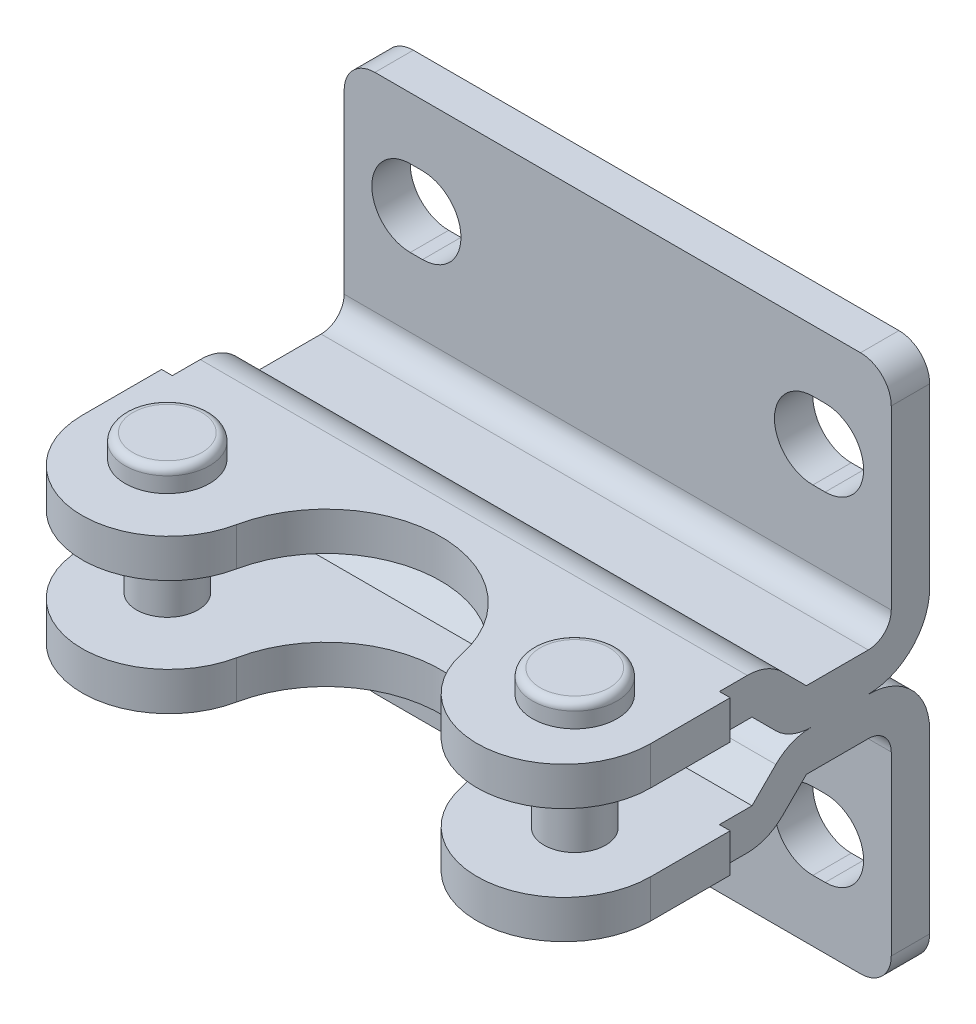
ISO-10303-21;
HEADER;
FILE_DESCRIPTION(('STEP AP214'),'2;1');
FILE_NAME('part.step','',(''),(''),'','','');
FILE_SCHEMA(('AUTOMOTIVE_DESIGN { 1 0 10303 214 1 1 1 1 }'));
ENDSEC;
DATA;
#1=APPLICATION_CONTEXT('core data for automotive mechanical design processes');
#2=APPLICATION_PROTOCOL_DEFINITION('international standard','automotive_design',2000,#1);
#3=PRODUCT_CONTEXT('',#1,'mechanical');
#4=PRODUCT('Part','Part','',(#3));
#5=PRODUCT_RELATED_PRODUCT_CATEGORY('part','',(#4));
#6=PRODUCT_DEFINITION_FORMATION('','',#4);
#7=PRODUCT_DEFINITION_CONTEXT('part definition',#1,'design');
#8=PRODUCT_DEFINITION('design','',#6,#7);
#9=PRODUCT_DEFINITION_SHAPE('','',#8);
#10=(LENGTH_UNIT() NAMED_UNIT(*) SI_UNIT(.MILLI.,.METRE.));
#11=(NAMED_UNIT(*) PLANE_ANGLE_UNIT() SI_UNIT($,.RADIAN.));
#12=(NAMED_UNIT(*) SI_UNIT($,.STERADIAN.) SOLID_ANGLE_UNIT());
#13=UNCERTAINTY_MEASURE_WITH_UNIT(LENGTH_MEASURE(1.E-05),#10,'distance_accuracy_value','');
#14=(GEOMETRIC_REPRESENTATION_CONTEXT(3) GLOBAL_UNCERTAINTY_ASSIGNED_CONTEXT((#13)) GLOBAL_UNIT_ASSIGNED_CONTEXT((#10,
#11,#12)) REPRESENTATION_CONTEXT('',''));
#15=CARTESIAN_POINT('',(0.,0.,0.));
#16=DIRECTION('',(0.,0.,1.));
#17=DIRECTION('',(1.,0.,0.));
#18=AXIS2_PLACEMENT_3D('',#15,#16,#17);
#19=CARTESIAN_POINT('',(0.243,-6.49999999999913,18.55));
#20=DIRECTION('',(0.,1.,0.));
#21=DIRECTION('',(-0.420400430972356,0.,0.907338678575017));
#22=AXIS2_PLACEMENT_3D('',#19,#20,#21);
#23=CYLINDRICAL_SURFACE('',#22,2.);
#24=CARTESIAN_POINT('',(0.243,2.50000000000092,18.55));
#25=DIRECTION('',(0.,1.,0.));
#26=DIRECTION('',(0.,0.,1.));
#27=AXIS2_PLACEMENT_3D('',#24,#25,#26);
#28=CIRCLE('',#27,2.);
#29=CARTESIAN_POINT('',(0.243,2.50000000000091,20.55));
#30=VERTEX_POINT('',#29);
#31=EDGE_CURVE('E1301',#30,#30,#28,.F.);
#32=ORIENTED_EDGE('',*,*,#31,.T.);
#33=EDGE_LOOP('',(#32));
#34=FACE_BOUND('',#33,.T.);
#35=CARTESIAN_POINT('',(0.243,-2.5,18.55));
#36=DIRECTION('',(0.,-1.,0.));
#37=DIRECTION('',(0.,0.,-1.));
#38=AXIS2_PLACEMENT_3D('',#35,#36,#37);
#39=CIRCLE('',#38,2.);
#40=CARTESIAN_POINT('',(0.243,-2.49999999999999,16.55));
#41=VERTEX_POINT('',#40);
#42=EDGE_CURVE('E951',#41,#41,#39,.F.);
#43=ORIENTED_EDGE('',*,*,#42,.T.);
#44=EDGE_LOOP('',(#43));
#45=FACE_BOUND('',#44,.T.);
#46=ADVANCED_FACE('F16',(#34,#45),#23,.T.);
#47=CARTESIAN_POINT('',(13.5,-17.799999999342,0.));
#48=DIRECTION('',(0.,0.,1.));
#49=DIRECTION('',(-1.,0.,0.));
#50=AXIS2_PLACEMENT_3D('',#47,#48,#49);
#51=PLANE('',#50);
#52=DIRECTION('',(1.,0.,0.));
#53=VECTOR('',#52,1.);
#54=CARTESIAN_POINT('',(13.5,4.00000000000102,1.2490009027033E-13));
#55=LINE('',#54,#53);
#56=CARTESIAN_POINT('',(-4.3,4.00000000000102,1.2490009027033E-13));
#57=VERTEX_POINT('',#56);
#58=CARTESIAN_POINT('',(31.3,4.00000000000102,1.2490009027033E-13));
#59=VERTEX_POINT('',#58);
#60=EDGE_CURVE('E684',#57,#59,#55,.T.);
#61=ORIENTED_EDGE('',*,*,#60,.F.);
#62=DIRECTION('',(0.,1.,0.));
#63=VECTOR('',#62,1.);
#64=CARTESIAN_POINT('',(-4.3,-9.99999999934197,0.));
#65=LINE('',#64,#63);
#66=CARTESIAN_POINT('',(-4.3,15.500000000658,2.22044604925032E-13));
#67=VERTEX_POINT('',#66);
#68=EDGE_CURVE('E645',#57,#67,#65,.T.);
#69=ORIENTED_EDGE('',*,*,#68,.T.);
#70=CARTESIAN_POINT('',(-2.3,15.500000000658,2.22044604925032E-13));
#71=DIRECTION('',(0.,0.,-1.));
#72=DIRECTION('',(-1.,0.,0.));
#73=AXIS2_PLACEMENT_3D('',#70,#71,#72);
#74=CIRCLE('',#73,2.);
#75=CARTESIAN_POINT('',(-2.3,17.5000000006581,2.4980018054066E-13));
#76=VERTEX_POINT('',#75);
#77=EDGE_CURVE('E650',#67,#76,#74,.T.);
#78=ORIENTED_EDGE('',*,*,#77,.T.);
#79=DIRECTION('',(-1.,0.,0.));
#80=VECTOR('',#79,1.);
#81=CARTESIAN_POINT('',(32.,17.5000000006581,2.4980018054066E-13));
#82=LINE('',#81,#80);
#83=CARTESIAN_POINT('',(29.3,17.5000000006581,2.4980018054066E-13));
#84=VERTEX_POINT('',#83);
#85=EDGE_CURVE('E887',#84,#76,#82,.T.);
#86=ORIENTED_EDGE('',*,*,#85,.F.);
#87=CARTESIAN_POINT('',(29.3,15.500000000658,2.22044604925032E-13));
#88=DIRECTION('',(0.,0.,-1.));
#89=DIRECTION('',(-1.,0.,0.));
#90=AXIS2_PLACEMENT_3D('',#87,#88,#89);
#91=CIRCLE('',#90,2.);
#92=CARTESIAN_POINT('',(31.3,15.500000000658,2.22044604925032E-13));
#93=VERTEX_POINT('',#92);
#94=EDGE_CURVE('E685',#84,#93,#91,.T.);
#95=ORIENTED_EDGE('',*,*,#94,.T.);
#96=DIRECTION('',(0.,-1.,0.));
#97=VECTOR('',#96,1.);
#98=CARTESIAN_POINT('',(31.3,-17.799999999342,0.));
#99=LINE('',#98,#97);
#100=EDGE_CURVE('E689',#93,#59,#99,.T.);
#101=ORIENTED_EDGE('',*,*,#100,.T.);
#102=EDGE_LOOP('',(#61,#69,#78,#86,#95,#101));
#103=FACE_BOUND('',#102,.T.);
#104=DIRECTION('',(1.,0.,0.));
#105=VECTOR('',#104,1.);
#106=CARTESIAN_POINT('',(13.5,8.50000000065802,1.66533453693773E-13));
#107=LINE('',#106,#105);
#108=CARTESIAN_POINT('',(26.2,8.50000000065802,1.66533453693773E-13));
#109=VERTEX_POINT('',#108);
#110=CARTESIAN_POINT('',(27.,8.50000000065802,1.66533453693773E-13));
#111=VERTEX_POINT('',#110);
#112=EDGE_CURVE('E755',#109,#111,#107,.T.);
#113=ORIENTED_EDGE('',*,*,#112,.T.);
#114=CARTESIAN_POINT('',(27.,11.000000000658,1.94289029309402E-13));
#115=DIRECTION('',(0.,0.,1.));
#116=DIRECTION('',(-1.,0.,0.));
#117=AXIS2_PLACEMENT_3D('',#114,#115,#116);
#118=CIRCLE('',#117,2.5);
#119=CARTESIAN_POINT('',(27.,13.500000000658,2.08166817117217E-13));
#120=VERTEX_POINT('',#119);
#121=EDGE_CURVE('E759',#111,#120,#118,.T.);
#122=ORIENTED_EDGE('',*,*,#121,.T.);
#123=DIRECTION('',(-1.,0.,0.));
#124=VECTOR('',#123,1.);
#125=CARTESIAN_POINT('',(13.5,13.500000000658,2.08166817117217E-13));
#126=LINE('',#125,#124);
#127=CARTESIAN_POINT('',(26.2,13.500000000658,2.08166817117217E-13));
#128=VERTEX_POINT('',#127);
#129=EDGE_CURVE('E798',#120,#128,#126,.T.);
#130=ORIENTED_EDGE('',*,*,#129,.T.);
#131=CARTESIAN_POINT('',(26.2,11.000000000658,1.94289029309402E-13));
#132=DIRECTION('',(0.,0.,1.));
#133=DIRECTION('',(-1.,0.,0.));
#134=AXIS2_PLACEMENT_3D('',#131,#132,#133);
#135=CIRCLE('',#134,2.5);
#136=EDGE_CURVE('E742',#128,#109,#135,.T.);
#137=ORIENTED_EDGE('',*,*,#136,.T.);
#138=EDGE_LOOP('',(#113,#122,#130,#137));
#139=FACE_BOUND('',#138,.T.);
#140=DIRECTION('',(-1.,0.,0.));
#141=VECTOR('',#140,1.);
#142=CARTESIAN_POINT('',(13.5,13.500000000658,2.08166817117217E-13));
#143=LINE('',#142,#141);
#144=CARTESIAN_POINT('',(0.8,13.500000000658,2.08166817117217E-13));
#145=VERTEX_POINT('',#144);
#146=CARTESIAN_POINT('',(0.,13.500000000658,2.08166817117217E-13));
#147=VERTEX_POINT('',#146);
#148=EDGE_CURVE('E671',#145,#147,#143,.T.);
#149=ORIENTED_EDGE('',*,*,#148,.T.);
#150=CARTESIAN_POINT('',(0.,11.000000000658,1.94289029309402E-13));
#151=DIRECTION('',(0.,0.,1.));
#152=DIRECTION('',(-1.,0.,0.));
#153=AXIS2_PLACEMENT_3D('',#150,#151,#152);
#154=CIRCLE('',#153,2.5);
#155=CARTESIAN_POINT('',(0.,8.50000000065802,1.66533453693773E-13));
#156=VERTEX_POINT('',#155);
#157=EDGE_CURVE('E668',#147,#156,#154,.T.);
#158=ORIENTED_EDGE('',*,*,#157,.T.);
#159=DIRECTION('',(1.,0.,0.));
#160=VECTOR('',#159,1.);
#161=CARTESIAN_POINT('',(13.5,8.50000000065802,1.66533453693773E-13));
#162=LINE('',#161,#160);
#163=CARTESIAN_POINT('',(0.8,8.50000000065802,1.66533453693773E-13));
#164=VERTEX_POINT('',#163);
#165=EDGE_CURVE('E672',#156,#164,#162,.T.);
#166=ORIENTED_EDGE('',*,*,#165,.T.);
#167=CARTESIAN_POINT('',(0.8,11.000000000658,1.94289029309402E-13));
#168=DIRECTION('',(0.,0.,1.));
#169=DIRECTION('',(-1.,0.,0.));
#170=AXIS2_PLACEMENT_3D('',#167,#168,#169);
#171=CIRCLE('',#170,2.5);
#172=EDGE_CURVE('E730',#164,#145,#171,.T.);
#173=ORIENTED_EDGE('',*,*,#172,.T.);
#174=EDGE_LOOP('',(#149,#158,#166,#173));
#175=FACE_BOUND('',#174,.T.);
#176=ADVANCED_FACE('F1342',(#103,#139,#175),#51,.F.);
#177=CARTESIAN_POINT('',(13.5,17.799999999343,0.));
#178=DIRECTION('',(0.,0.,1.));
#179=DIRECTION('',(1.,0.,0.));
#180=AXIS2_PLACEMENT_3D('',#177,#178,#179);
#181=PLANE('',#180);
#182=DIRECTION('',(-1.,0.,0.));
#183=VECTOR('',#182,1.);
#184=CARTESIAN_POINT('',(13.5,-4.,0.));
#185=LINE('',#184,#183);
#186=CARTESIAN_POINT('',(31.3,-4.,0.));
#187=VERTEX_POINT('',#186);
#188=CARTESIAN_POINT('',(-4.3,-4.,0.));
#189=VERTEX_POINT('',#188);
#190=EDGE_CURVE('E556',#187,#189,#185,.T.);
#191=ORIENTED_EDGE('',*,*,#190,.F.);
#192=DIRECTION('',(0.,-1.,0.));
#193=VECTOR('',#192,1.);
#194=CARTESIAN_POINT('',(31.3,9.99999999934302,0.));
#195=LINE('',#194,#193);
#196=CARTESIAN_POINT('',(31.3,-15.500000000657,0.));
#197=VERTEX_POINT('',#196);
#198=EDGE_CURVE('E1083',#187,#197,#195,.T.);
#199=ORIENTED_EDGE('',*,*,#198,.T.);
#200=CARTESIAN_POINT('',(29.3,-15.500000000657,0.));
#201=DIRECTION('',(0.,0.,-1.));
#202=DIRECTION('',(1.,0.,0.));
#203=AXIS2_PLACEMENT_3D('',#200,#201,#202);
#204=CIRCLE('',#203,2.);
#205=CARTESIAN_POINT('',(29.3,-17.500000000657,0.));
#206=VERTEX_POINT('',#205);
#207=EDGE_CURVE('E1080',#197,#206,#204,.T.);
#208=ORIENTED_EDGE('',*,*,#207,.T.);
#209=DIRECTION('',(1.,0.,0.));
#210=VECTOR('',#209,1.);
#211=CARTESIAN_POINT('',(-5.,-17.500000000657,0.));
#212=LINE('',#211,#210);
#213=CARTESIAN_POINT('',(-2.3,-17.500000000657,0.));
#214=VERTEX_POINT('',#213);
#215=EDGE_CURVE('E610',#214,#206,#212,.T.);
#216=ORIENTED_EDGE('',*,*,#215,.F.);
#217=CARTESIAN_POINT('',(-2.3,-15.500000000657,0.));
#218=DIRECTION('',(0.,0.,-1.));
#219=DIRECTION('',(1.,0.,0.));
#220=AXIS2_PLACEMENT_3D('',#217,#218,#219);
#221=CIRCLE('',#220,2.);
#222=CARTESIAN_POINT('',(-4.3,-15.500000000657,0.));
#223=VERTEX_POINT('',#222);
#224=EDGE_CURVE('E644',#214,#223,#221,.T.);
#225=ORIENTED_EDGE('',*,*,#224,.T.);
#226=DIRECTION('',(0.,1.,0.));
#227=VECTOR('',#226,1.);
#228=CARTESIAN_POINT('',(-4.3,17.799999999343,0.));
#229=LINE('',#228,#227);
#230=EDGE_CURVE('E640',#223,#189,#229,.T.);
#231=ORIENTED_EDGE('',*,*,#230,.T.);
#232=EDGE_LOOP('',(#191,#199,#208,#216,#225,#231));
#233=FACE_BOUND('',#232,.T.);
#234=DIRECTION('',(-1.,0.,0.));
#235=VECTOR('',#234,1.);
#236=CARTESIAN_POINT('',(13.5,-8.50000000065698,0.));
#237=LINE('',#236,#235);
#238=CARTESIAN_POINT('',(0.8,-8.50000000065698,0.));
#239=VERTEX_POINT('',#238);
#240=CARTESIAN_POINT('',(0.,-8.50000000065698,0.));
#241=VERTEX_POINT('',#240);
#242=EDGE_CURVE('E594',#239,#241,#237,.T.);
#243=ORIENTED_EDGE('',*,*,#242,.T.);
#244=CARTESIAN_POINT('',(0.,-11.000000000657,0.));
#245=DIRECTION('',(0.,0.,1.));
#246=DIRECTION('',(1.,0.,0.));
#247=AXIS2_PLACEMENT_3D('',#244,#245,#246);
#248=CIRCLE('',#247,2.5);
#249=CARTESIAN_POINT('',(0.,-13.500000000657,0.));
#250=VERTEX_POINT('',#249);
#251=EDGE_CURVE('E591',#241,#250,#248,.T.);
#252=ORIENTED_EDGE('',*,*,#251,.T.);
#253=DIRECTION('',(1.,0.,0.));
#254=VECTOR('',#253,1.);
#255=CARTESIAN_POINT('',(13.5,-13.500000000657,0.));
#256=LINE('',#255,#254);
#257=CARTESIAN_POINT('',(0.8,-13.500000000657,0.));
#258=VERTEX_POINT('',#257);
#259=EDGE_CURVE('E595',#250,#258,#256,.T.);
#260=ORIENTED_EDGE('',*,*,#259,.T.);
#261=CARTESIAN_POINT('',(0.8,-11.000000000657,0.));
#262=DIRECTION('',(0.,0.,1.));
#263=DIRECTION('',(1.,0.,0.));
#264=AXIS2_PLACEMENT_3D('',#261,#262,#263);
#265=CIRCLE('',#264,2.5);
#266=EDGE_CURVE('E539',#258,#239,#265,.T.);
#267=ORIENTED_EDGE('',*,*,#266,.T.);
#268=EDGE_LOOP('',(#243,#252,#260,#267));
#269=FACE_BOUND('',#268,.T.);
#270=DIRECTION('',(1.,0.,0.));
#271=VECTOR('',#270,1.);
#272=CARTESIAN_POINT('',(13.5,-13.500000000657,0.));
#273=LINE('',#272,#271);
#274=CARTESIAN_POINT('',(26.2,-13.500000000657,0.));
#275=VERTEX_POINT('',#274);
#276=CARTESIAN_POINT('',(27.,-13.500000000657,0.));
#277=VERTEX_POINT('',#276);
#278=EDGE_CURVE('E1133',#275,#277,#273,.T.);
#279=ORIENTED_EDGE('',*,*,#278,.T.);
#280=CARTESIAN_POINT('',(27.,-11.000000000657,0.));
#281=DIRECTION('',(0.,0.,1.));
#282=DIRECTION('',(1.,0.,0.));
#283=AXIS2_PLACEMENT_3D('',#280,#281,#282);
#284=CIRCLE('',#283,2.5);
#285=CARTESIAN_POINT('',(27.,-8.50000000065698,0.));
#286=VERTEX_POINT('',#285);
#287=EDGE_CURVE('E1105',#277,#286,#284,.T.);
#288=ORIENTED_EDGE('',*,*,#287,.T.);
#289=DIRECTION('',(-1.,0.,0.));
#290=VECTOR('',#289,1.);
#291=CARTESIAN_POINT('',(13.5,-8.50000000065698,0.));
#292=LINE('',#291,#290);
#293=CARTESIAN_POINT('',(26.2,-8.50000000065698,0.));
#294=VERTEX_POINT('',#293);
#295=EDGE_CURVE('E1101',#286,#294,#292,.T.);
#296=ORIENTED_EDGE('',*,*,#295,.T.);
#297=CARTESIAN_POINT('',(26.2,-11.000000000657,0.));
#298=DIRECTION('',(0.,0.,1.));
#299=DIRECTION('',(1.,0.,0.));
#300=AXIS2_PLACEMENT_3D('',#297,#298,#299);
#301=CIRCLE('',#300,2.5);
#302=EDGE_CURVE('E1106',#294,#275,#301,.T.);
#303=ORIENTED_EDGE('',*,*,#302,.T.);
#304=EDGE_LOOP('',(#279,#288,#296,#303));
#305=FACE_BOUND('',#304,.T.);
#306=ADVANCED_FACE('F1344',(#233,#269,#305),#181,.F.);
#307=CARTESIAN_POINT('',(0.,11.0000000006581,-7.49999999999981));
#308=DIRECTION('',(0.,0.,1.));
#309=DIRECTION('',(-1.,0.,0.));
#310=AXIS2_PLACEMENT_3D('',#307,#308,#309);
#311=CYLINDRICAL_SURFACE('',#310,2.5);
#312=DIRECTION('',(0.,0.,1.));
#313=VECTOR('',#312,1.);
#314=CARTESIAN_POINT('',(0.,8.50000000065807,-7.49999999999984));
#315=LINE('',#314,#313);
#316=CARTESIAN_POINT('',(0.,8.50000000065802,2.50000000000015));
#317=VERTEX_POINT('',#316);
#318=EDGE_CURVE('E846',#156,#317,#315,.T.);
#319=ORIENTED_EDGE('',*,*,#318,.F.);
#320=ORIENTED_EDGE('',*,*,#157,.F.);
#321=DIRECTION('',(0.,0.,1.));
#322=VECTOR('',#321,1.);
#323=CARTESIAN_POINT('',(0.,13.5000000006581,-7.4999999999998));
#324=LINE('',#323,#322);
#325=CARTESIAN_POINT('',(0.,13.500000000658,2.5000000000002));
#326=VERTEX_POINT('',#325);
#327=EDGE_CURVE('E710',#147,#326,#324,.T.);
#328=ORIENTED_EDGE('',*,*,#327,.T.);
#329=CARTESIAN_POINT('',(0.,11.000000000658,2.50000000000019));
#330=DIRECTION('',(0.,0.,1.));
#331=DIRECTION('',(-1.,0.,0.));
#332=AXIS2_PLACEMENT_3D('',#329,#330,#331);
#333=CIRCLE('',#332,2.5);
#334=EDGE_CURVE('E677',#326,#317,#333,.T.);
#335=ORIENTED_EDGE('',*,*,#334,.T.);
#336=EDGE_LOOP('',(#319,#320,#328,#335));
#337=FACE_BOUND('',#336,.T.);
#338=ADVANCED_FACE('F1352',(#337),#311,.F.);
#339=CARTESIAN_POINT('',(0.,8.50000000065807,-7.49999999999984));
#340=DIRECTION('',(0.,-1.,0.));
#341=DIRECTION('',(-1.,0.,0.));
#342=AXIS2_PLACEMENT_3D('',#339,#340,#341);
#343=PLANE('',#342);
#344=ORIENTED_EDGE('',*,*,#318,.T.);
#345=DIRECTION('',(1.,0.,0.));
#346=VECTOR('',#345,1.);
#347=CARTESIAN_POINT('',(0.,8.50000000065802,2.50000000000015));
#348=LINE('',#347,#346);
#349=CARTESIAN_POINT('',(0.8,8.50000000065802,2.50000000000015));
#350=VERTEX_POINT('',#349);
#351=EDGE_CURVE('E843',#317,#350,#348,.T.);
#352=ORIENTED_EDGE('',*,*,#351,.T.);
#353=DIRECTION('',(0.,0.,1.));
#354=VECTOR('',#353,1.);
#355=CARTESIAN_POINT('',(0.8,8.50000000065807,-7.49999999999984));
#356=LINE('',#355,#354);
#357=EDGE_CURVE('E809',#164,#350,#356,.T.);
#358=ORIENTED_EDGE('',*,*,#357,.F.);
#359=ORIENTED_EDGE('',*,*,#165,.F.);
#360=EDGE_LOOP('',(#344,#352,#358,#359));
#361=FACE_BOUND('',#360,.T.);
#362=ADVANCED_FACE('F1360',(#361),#343,.F.);
#363=CARTESIAN_POINT('',(0.8,11.0000000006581,-7.49999999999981));
#364=DIRECTION('',(0.,0.,1.));
#365=DIRECTION('',(-1.,0.,0.));
#366=AXIS2_PLACEMENT_3D('',#363,#364,#365);
#367=CYLINDRICAL_SURFACE('',#366,2.5);
#368=ORIENTED_EDGE('',*,*,#357,.T.);
#369=CARTESIAN_POINT('',(0.8,11.000000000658,2.50000000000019));
#370=DIRECTION('',(0.,0.,1.));
#371=DIRECTION('',(-1.,0.,0.));
#372=AXIS2_PLACEMENT_3D('',#369,#370,#371);
#373=CIRCLE('',#372,2.5);
#374=CARTESIAN_POINT('',(0.8,13.500000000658,2.5000000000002));
#375=VERTEX_POINT('',#374);
#376=EDGE_CURVE('E875',#350,#375,#373,.T.);
#377=ORIENTED_EDGE('',*,*,#376,.T.);
#378=DIRECTION('',(0.,0.,1.));
#379=VECTOR('',#378,1.);
#380=CARTESIAN_POINT('',(0.8,13.5000000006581,-7.4999999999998));
#381=LINE('',#380,#379);
#382=EDGE_CURVE('E706',#145,#375,#381,.T.);
#383=ORIENTED_EDGE('',*,*,#382,.F.);
#384=ORIENTED_EDGE('',*,*,#172,.F.);
#385=EDGE_LOOP('',(#368,#377,#383,#384));
#386=FACE_BOUND('',#385,.T.);
#387=ADVANCED_FACE('F1382',(#386),#367,.F.);
#388=CARTESIAN_POINT('',(0.,13.5000000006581,-7.4999999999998));
#389=DIRECTION('',(0.,1.,0.));
#390=DIRECTION('',(0.,0.,-1.));
#391=AXIS2_PLACEMENT_3D('',#388,#389,#390);
#392=PLANE('',#391);
#393=ORIENTED_EDGE('',*,*,#382,.T.);
#394=DIRECTION('',(-1.,0.,0.));
#395=VECTOR('',#394,1.);
#396=CARTESIAN_POINT('',(0.,13.500000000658,2.5000000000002));
#397=LINE('',#396,#395);
#398=EDGE_CURVE('E711',#375,#326,#397,.T.);
#399=ORIENTED_EDGE('',*,*,#398,.T.);
#400=ORIENTED_EDGE('',*,*,#327,.F.);
#401=ORIENTED_EDGE('',*,*,#148,.F.);
#402=EDGE_LOOP('',(#393,#399,#400,#401));
#403=FACE_BOUND('',#402,.T.);
#404=ADVANCED_FACE('F1385',(#403),#392,.F.);
#405=CARTESIAN_POINT('',(27.,13.5000000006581,-7.4999999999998));
#406=DIRECTION('',(0.,1.,0.));
#407=DIRECTION('',(0.,0.,-1.));
#408=AXIS2_PLACEMENT_3D('',#405,#406,#407);
#409=PLANE('',#408);
#410=DIRECTION('',(0.,0.,1.));
#411=VECTOR('',#410,1.);
#412=CARTESIAN_POINT('',(27.,13.5000000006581,-7.4999999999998));
#413=LINE('',#412,#411);
#414=CARTESIAN_POINT('',(27.,13.500000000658,2.5000000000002));
#415=VERTEX_POINT('',#414);
#416=EDGE_CURVE('E705',#120,#415,#413,.T.);
#417=ORIENTED_EDGE('',*,*,#416,.T.);
#418=DIRECTION('',(-1.,0.,0.));
#419=VECTOR('',#418,1.);
#420=CARTESIAN_POINT('',(27.,13.500000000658,2.5000000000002));
#421=LINE('',#420,#419);
#422=CARTESIAN_POINT('',(26.2,13.500000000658,2.5000000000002));
#423=VERTEX_POINT('',#422);
#424=EDGE_CURVE('E702',#415,#423,#421,.T.);
#425=ORIENTED_EDGE('',*,*,#424,.T.);
#426=DIRECTION('',(0.,0.,1.));
#427=VECTOR('',#426,1.);
#428=CARTESIAN_POINT('',(26.2,13.5000000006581,-7.4999999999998));
#429=LINE('',#428,#427);
#430=EDGE_CURVE('E819',#128,#423,#429,.T.);
#431=ORIENTED_EDGE('',*,*,#430,.F.);
#432=ORIENTED_EDGE('',*,*,#129,.F.);
#433=EDGE_LOOP('',(#417,#425,#431,#432));
#434=FACE_BOUND('',#433,.T.);
#435=ADVANCED_FACE('F1396',(#434),#409,.F.);
#436=CARTESIAN_POINT('',(26.2,11.0000000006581,-7.49999999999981));
#437=DIRECTION('',(0.,0.,1.));
#438=DIRECTION('',(-1.,0.,0.));
#439=AXIS2_PLACEMENT_3D('',#436,#437,#438);
#440=CYLINDRICAL_SURFACE('',#439,2.5);
#441=ORIENTED_EDGE('',*,*,#430,.T.);
#442=CARTESIAN_POINT('',(26.2,11.000000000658,2.50000000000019));
#443=DIRECTION('',(0.,0.,1.));
#444=DIRECTION('',(-1.,0.,0.));
#445=AXIS2_PLACEMENT_3D('',#442,#443,#444);
#446=CIRCLE('',#445,2.5);
#447=CARTESIAN_POINT('',(26.2,8.50000000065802,2.50000000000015));
#448=VERTEX_POINT('',#447);
#449=EDGE_CURVE('E536',#423,#448,#446,.T.);
#450=ORIENTED_EDGE('',*,*,#449,.T.);
#451=DIRECTION('',(0.,0.,1.));
#452=VECTOR('',#451,1.);
#453=CARTESIAN_POINT('',(26.2,8.50000000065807,-7.49999999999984));
#454=LINE('',#453,#452);
#455=EDGE_CURVE('E773',#109,#448,#454,.T.);
#456=ORIENTED_EDGE('',*,*,#455,.F.);
#457=ORIENTED_EDGE('',*,*,#136,.F.);
#458=EDGE_LOOP('',(#441,#450,#456,#457));
#459=FACE_BOUND('',#458,.T.);
#460=ADVANCED_FACE('F1392',(#459),#440,.F.);
#461=CARTESIAN_POINT('',(27.,8.50000000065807,-7.49999999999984));
#462=DIRECTION('',(0.,-1.,0.));
#463=DIRECTION('',(-1.,0.,0.));
#464=AXIS2_PLACEMENT_3D('',#461,#462,#463);
#465=PLANE('',#464);
#466=ORIENTED_EDGE('',*,*,#455,.T.);
#467=DIRECTION('',(1.,0.,0.));
#468=VECTOR('',#467,1.);
#469=CARTESIAN_POINT('',(27.,8.50000000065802,2.50000000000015));
#470=LINE('',#469,#468);
#471=CARTESIAN_POINT('',(27.,8.50000000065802,2.50000000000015));
#472=VERTEX_POINT('',#471);
#473=EDGE_CURVE('E777',#448,#472,#470,.T.);
#474=ORIENTED_EDGE('',*,*,#473,.T.);
#475=DIRECTION('',(0.,0.,1.));
#476=VECTOR('',#475,1.);
#477=CARTESIAN_POINT('',(27.,8.50000000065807,-7.49999999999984));
#478=LINE('',#477,#476);
#479=EDGE_CURVE('E813',#111,#472,#478,.T.);
#480=ORIENTED_EDGE('',*,*,#479,.F.);
#481=ORIENTED_EDGE('',*,*,#112,.F.);
#482=EDGE_LOOP('',(#466,#474,#480,#481));
#483=FACE_BOUND('',#482,.T.);
#484=ADVANCED_FACE('F1395',(#483),#465,.F.);
#485=CARTESIAN_POINT('',(27.,11.0000000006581,-7.49999999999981));
#486=DIRECTION('',(0.,0.,1.));
#487=DIRECTION('',(-1.,0.,0.));
#488=AXIS2_PLACEMENT_3D('',#485,#486,#487);
#489=CYLINDRICAL_SURFACE('',#488,2.5);
#490=ORIENTED_EDGE('',*,*,#479,.T.);
#491=CARTESIAN_POINT('',(27.,11.000000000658,2.50000000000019));
#492=DIRECTION('',(0.,0.,1.));
#493=DIRECTION('',(-1.,0.,0.));
#494=AXIS2_PLACEMENT_3D('',#491,#492,#493);
#495=CIRCLE('',#494,2.5);
#496=EDGE_CURVE('E776',#472,#415,#495,.T.);
#497=ORIENTED_EDGE('',*,*,#496,.T.);
#498=ORIENTED_EDGE('',*,*,#416,.F.);
#499=ORIENTED_EDGE('',*,*,#121,.F.);
#500=EDGE_LOOP('',(#490,#497,#498,#499));
#501=FACE_BOUND('',#500,.T.);
#502=ADVANCED_FACE('F1366',(#501),#489,.F.);
#503=CARTESIAN_POINT('',(-2.3,15.500000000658,2.50000000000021));
#504=DIRECTION('',(0.,0.,1.));
#505=DIRECTION('',(-1.,0.,0.));
#506=AXIS2_PLACEMENT_3D('',#503,#504,#505);
#507=CYLINDRICAL_SURFACE('',#506,2.);
#508=ORIENTED_EDGE('',*,*,#77,.F.);
#509=DIRECTION('',(0.,0.,-1.));
#510=VECTOR('',#509,1.);
#511=CARTESIAN_POINT('',(-4.3,15.500000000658,2.22044604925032E-13));
#512=LINE('',#511,#510);
#513=CARTESIAN_POINT('',(-4.3,15.500000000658,2.50000000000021));
#514=VERTEX_POINT('',#513);
#515=EDGE_CURVE('E649',#514,#67,#512,.T.);
#516=ORIENTED_EDGE('',*,*,#515,.F.);
#517=CARTESIAN_POINT('',(-2.3,15.500000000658,2.50000000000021));
#518=DIRECTION('',(0.,0.,1.));
#519=DIRECTION('',(-1.,0.,0.));
#520=AXIS2_PLACEMENT_3D('',#517,#518,#519);
#521=CIRCLE('',#520,2.);
#522=CARTESIAN_POINT('',(-2.3,17.5000000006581,2.50000000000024));
#523=VERTEX_POINT('',#522);
#524=EDGE_CURVE('E683',#523,#514,#521,.T.);
#525=ORIENTED_EDGE('',*,*,#524,.F.);
#526=DIRECTION('',(0.,0.,1.));
#527=VECTOR('',#526,1.);
#528=CARTESIAN_POINT('',(-2.3,17.5000000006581,2.50000000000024));
#529=LINE('',#528,#527);
#530=EDGE_CURVE('E903',#76,#523,#529,.T.);
#531=ORIENTED_EDGE('',*,*,#530,.F.);
#532=EDGE_LOOP('',(#508,#516,#525,#531));
#533=FACE_BOUND('',#532,.T.);
#534=ADVANCED_FACE('F1362',(#533),#507,.T.);
#535=CARTESIAN_POINT('',(32.,17.5000000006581,2.50000000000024));
#536=DIRECTION('',(0.,-1.,0.));
#537=DIRECTION('',(-1.,0.,0.));
#538=AXIS2_PLACEMENT_3D('',#535,#536,#537);
#539=PLANE('',#538);
#540=DIRECTION('',(-1.,0.,0.));
#541=VECTOR('',#540,1.);
#542=CARTESIAN_POINT('',(32.,17.5000000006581,2.50000000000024));
#543=LINE('',#542,#541);
#544=CARTESIAN_POINT('',(29.3,17.5000000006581,2.50000000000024));
#545=VERTEX_POINT('',#544);
#546=EDGE_CURVE('E825',#545,#523,#543,.T.);
#547=ORIENTED_EDGE('',*,*,#546,.F.);
#548=DIRECTION('',(0.,0.,-1.));
#549=VECTOR('',#548,1.);
#550=CARTESIAN_POINT('',(29.3,17.5000000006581,2.50000000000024));
#551=LINE('',#550,#549);
#552=EDGE_CURVE('E805',#545,#84,#551,.T.);
#553=ORIENTED_EDGE('',*,*,#552,.T.);
#554=ORIENTED_EDGE('',*,*,#85,.T.);
#555=ORIENTED_EDGE('',*,*,#530,.T.);
#556=EDGE_LOOP('',(#547,#553,#554,#555));
#557=FACE_BOUND('',#556,.T.);
#558=ADVANCED_FACE('F1365',(#557),#539,.F.);
#559=CARTESIAN_POINT('',(29.3,15.500000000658,2.50000000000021));
#560=DIRECTION('',(0.,0.,-1.));
#561=DIRECTION('',(1.,0.,0.));
#562=AXIS2_PLACEMENT_3D('',#559,#560,#561);
#563=CYLINDRICAL_SURFACE('',#562,2.);
#564=CARTESIAN_POINT('',(29.3,15.500000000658,2.50000000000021));
#565=DIRECTION('',(0.,0.,1.));
#566=DIRECTION('',(-1.,0.,0.));
#567=AXIS2_PLACEMENT_3D('',#564,#565,#566);
#568=CIRCLE('',#567,2.);
#569=CARTESIAN_POINT('',(31.3,15.500000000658,2.50000000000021));
#570=VERTEX_POINT('',#569);
#571=EDGE_CURVE('E857',#570,#545,#568,.T.);
#572=ORIENTED_EDGE('',*,*,#571,.F.);
#573=DIRECTION('',(0.,0.,1.));
#574=VECTOR('',#573,1.);
#575=CARTESIAN_POINT('',(31.3,15.500000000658,2.22044604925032E-13));
#576=LINE('',#575,#574);
#577=EDGE_CURVE('E733',#93,#570,#576,.T.);
#578=ORIENTED_EDGE('',*,*,#577,.F.);
#579=ORIENTED_EDGE('',*,*,#94,.F.);
#580=ORIENTED_EDGE('',*,*,#552,.F.);
#581=EDGE_LOOP('',(#572,#578,#579,#580));
#582=FACE_BOUND('',#581,.T.);
#583=ADVANCED_FACE('F1424',(#582),#563,.T.);
#584=CARTESIAN_POINT('',(-4.3,-9.99999999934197,0.));
#585=DIRECTION('',(1.,0.,0.));
#586=DIRECTION('',(0.,-1.,0.));
#587=AXIS2_PLACEMENT_3D('',#584,#585,#586);
#588=PLANE('',#587);
#589=ORIENTED_EDGE('',*,*,#68,.F.);
#590=CARTESIAN_POINT('',(-4.3,4.00000000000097,4.00000000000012));
#591=DIRECTION('',(-1.,0.,0.));
#592=DIRECTION('',(0.,0.,1.));
#593=AXIS2_PLACEMENT_3D('',#590,#591,#592);
#594=CIRCLE('',#593,4.);
#595=CARTESIAN_POINT('',(-4.3,0.,4.));
#596=VERTEX_POINT('',#595);
#597=EDGE_CURVE('E679',#57,#596,#594,.T.);
#598=ORIENTED_EDGE('',*,*,#597,.T.);
#599=CARTESIAN_POINT('',(-4.3,-4.,3.99999999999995));
#600=DIRECTION('',(-1.,0.,0.));
#601=DIRECTION('',(0.,0.,1.));
#602=AXIS2_PLACEMENT_3D('',#599,#600,#601);
#603=CIRCLE('',#602,4.);
#604=EDGE_CURVE('E552',#596,#189,#603,.T.);
#605=ORIENTED_EDGE('',*,*,#604,.T.);
#606=ORIENTED_EDGE('',*,*,#230,.F.);
#607=DIRECTION('',(0.,0.,1.));
#608=VECTOR('',#607,1.);
#609=CARTESIAN_POINT('',(-4.3,-15.500000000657,0.));
#610=LINE('',#609,#608);
#611=CARTESIAN_POINT('',(-4.3,-15.500000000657,2.49999999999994));
#612=VERTEX_POINT('',#611);
#613=EDGE_CURVE('E1110',#223,#612,#610,.T.);
#614=ORIENTED_EDGE('',*,*,#613,.T.);
#615=DIRECTION('',(0.,1.,0.));
#616=VECTOR('',#615,1.);
#617=CARTESIAN_POINT('',(-4.3,9.99999999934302,2.49999999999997));
#618=LINE('',#617,#616);
#619=CARTESIAN_POINT('',(-4.3,-3.99999999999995,2.49999999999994));
#620=VERTEX_POINT('',#619);
#621=EDGE_CURVE('E1114',#612,#620,#618,.T.);
#622=ORIENTED_EDGE('',*,*,#621,.T.);
#623=CARTESIAN_POINT('',(-4.3,-4.,3.99999999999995));
#624=DIRECTION('',(-1.,0.,0.));
#625=DIRECTION('',(0.,0.,-1.));
#626=AXIS2_PLACEMENT_3D('',#623,#624,#625);
#627=CIRCLE('',#626,1.5);
#628=CARTESIAN_POINT('',(-4.3,-2.49999999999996,4.));
#629=VERTEX_POINT('',#628);
#630=EDGE_CURVE('E558',#629,#620,#627,.T.);
#631=ORIENTED_EDGE('',*,*,#630,.F.);
#632=DIRECTION('',(0.,0.,1.));
#633=VECTOR('',#632,1.);
#634=CARTESIAN_POINT('',(-4.3,-2.5,13.680310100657));
#635=LINE('',#634,#633);
#636=CARTESIAN_POINT('',(-4.3,-2.5,8.0249737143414));
#637=VERTEX_POINT('',#636);
#638=EDGE_CURVE('E990',#629,#637,#635,.T.);
#639=ORIENTED_EDGE('',*,*,#638,.T.);
#640=DIRECTION('',(0.,-0.707106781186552,0.707106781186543));
#641=VECTOR('',#640,1.);
#642=CARTESIAN_POINT('',(-4.3,-5.82713809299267,11.3521118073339));
#643=LINE('',#642,#641);
#644=CARTESIAN_POINT('',(-4.3,-4.0520218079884,9.57699552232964));
#645=VERTEX_POINT('',#644);
#646=EDGE_CURVE('E628',#637,#645,#643,.T.);
#647=ORIENTED_EDGE('',*,*,#646,.T.);
#648=CARTESIAN_POINT('',(-4.3,-1.76339999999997,11.8656173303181));
#649=DIRECTION('',(1.,0.,0.));
#650=DIRECTION('',(0.,0.,1.));
#651=AXIS2_PLACEMENT_3D('',#648,#649,#650);
#652=CIRCLE('',#651,3.2366);
#653=CARTESIAN_POINT('',(-4.3,-5.,11.865617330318));
#654=VERTEX_POINT('',#653);
#655=EDGE_CURVE('E632',#654,#645,#652,.T.);
#656=ORIENTED_EDGE('',*,*,#655,.F.);
#657=DIRECTION('',(0.,0.,1.));
#658=VECTOR('',#657,1.);
#659=CARTESIAN_POINT('',(-4.3,-5.,12.815738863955));
#660=LINE('',#659,#658);
#661=CARTESIAN_POINT('',(-4.3,-5.,13.6803101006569));
#662=VERTEX_POINT('',#661);
#663=EDGE_CURVE('E1130',#654,#662,#660,.T.);
#664=ORIENTED_EDGE('',*,*,#663,.T.);
#665=DIRECTION('',(0.,-1.,0.));
#666=VECTOR('',#665,1.);
#667=CARTESIAN_POINT('',(-4.3,-9.99999999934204,13.6803101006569));
#668=LINE('',#667,#666);
#669=CARTESIAN_POINT('',(-4.3,-2.5,13.680310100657));
#670=VERTEX_POINT('',#669);
#671=EDGE_CURVE('E979',#670,#662,#668,.T.);
#672=ORIENTED_EDGE('',*,*,#671,.F.);
#673=DIRECTION('',(0.,0.,1.));
#674=VECTOR('',#673,1.);
#675=CARTESIAN_POINT('',(-4.3,-2.50000000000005,20.6157388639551));
#676=LINE('',#675,#674);
#677=CARTESIAN_POINT('',(-4.3,-2.5,11.560507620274));
#678=VERTEX_POINT('',#677);
#679=EDGE_CURVE('E459',#678,#670,#676,.T.);
#680=ORIENTED_EDGE('',*,*,#679,.F.);
#681=DIRECTION('',(0.,-0.707106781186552,0.707106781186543));
#682=VECTOR('',#681,1.);
#683=CARTESIAN_POINT('',(-4.3,-9.57480403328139,18.6353116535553));
#684=LINE('',#683,#682);
#685=CARTESIAN_POINT('',(-4.3,-0.947978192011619,10.0084858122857));
#686=VERTEX_POINT('',#685);
#687=EDGE_CURVE('E465',#686,#678,#684,.T.);
#688=ORIENTED_EDGE('',*,*,#687,.F.);
#689=CARTESIAN_POINT('',(-4.3,-3.2366,7.71986400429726));
#690=DIRECTION('',(-1.,0.,0.));
#691=DIRECTION('',(0.,0.,1.));
#692=AXIS2_PLACEMENT_3D('',#689,#690,#691);
#693=CIRCLE('',#692,3.2366);
#694=CARTESIAN_POINT('',(-4.3,0.,7.71986400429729));
#695=VERTEX_POINT('',#694);
#696=EDGE_CURVE('E605',#686,#695,#693,.T.);
#697=ORIENTED_EDGE('',*,*,#696,.T.);
#698=CARTESIAN_POINT('',(-4.3,3.23660000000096,7.71986400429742));
#699=DIRECTION('',(-1.,0.,0.));
#700=DIRECTION('',(0.,0.,1.));
#701=AXIS2_PLACEMENT_3D('',#698,#699,#700);
#702=CIRCLE('',#701,3.2366);
#703=CARTESIAN_POINT('',(-4.3,0.947978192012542,10.0084858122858));
#704=VERTEX_POINT('',#703);
#705=EDGE_CURVE('E791',#695,#704,#702,.T.);
#706=ORIENTED_EDGE('',*,*,#705,.T.);
#707=DIRECTION('',(0.,-0.707106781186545,-0.70710678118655));
#708=VECTOR('',#707,1.);
#709=CARTESIAN_POINT('',(-4.3,4.05937114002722,13.1198787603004));
#710=LINE('',#709,#708);
#711=CARTESIAN_POINT('',(-4.3,2.50000000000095,11.5605076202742));
#712=VERTEX_POINT('',#711);
#713=EDGE_CURVE('E678',#712,#704,#710,.T.);
#714=ORIENTED_EDGE('',*,*,#713,.F.);
#715=DIRECTION('',(0.,0.,-1.));
#716=VECTOR('',#715,1.);
#717=CARTESIAN_POINT('',(-4.3,2.50000000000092,12.8157388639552));
#718=LINE('',#717,#716);
#719=CARTESIAN_POINT('',(-4.3,2.50000000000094,13.6803101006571));
#720=VERTEX_POINT('',#719);
#721=EDGE_CURVE('E778',#720,#712,#718,.T.);
#722=ORIENTED_EDGE('',*,*,#721,.F.);
#723=DIRECTION('',(0.,1.,0.));
#724=VECTOR('',#723,1.);
#725=CARTESIAN_POINT('',(-4.3,2.50000000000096,13.6803101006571));
#726=LINE('',#725,#724);
#727=CARTESIAN_POINT('',(-4.3,5.00000000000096,13.6803101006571));
#728=VERTEX_POINT('',#727);
#729=EDGE_CURVE('E782',#720,#728,#726,.T.);
#730=ORIENTED_EDGE('',*,*,#729,.T.);
#731=DIRECTION('',(0.,0.,-1.));
#732=VECTOR('',#731,1.);
#733=CARTESIAN_POINT('',(-4.3,5.00000000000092,12.8157388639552));
#734=LINE('',#733,#732);
#735=CARTESIAN_POINT('',(-4.3,5.00000000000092,11.8656173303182));
#736=VERTEX_POINT('',#735);
#737=EDGE_CURVE('E772',#728,#736,#734,.T.);
#738=ORIENTED_EDGE('',*,*,#737,.T.);
#739=CARTESIAN_POINT('',(-4.3,1.76340000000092,11.8656173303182));
#740=DIRECTION('',(1.,0.,0.));
#741=DIRECTION('',(0.,0.,-1.));
#742=AXIS2_PLACEMENT_3D('',#739,#740,#741);
#743=CIRCLE('',#742,3.2366);
#744=CARTESIAN_POINT('',(-4.3,4.05202180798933,9.57699552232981));
#745=VERTEX_POINT('',#744);
#746=EDGE_CURVE('E720',#745,#736,#743,.T.);
#747=ORIENTED_EDGE('',*,*,#746,.F.);
#748=DIRECTION('',(0.,-0.707106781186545,-0.70710678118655));
#749=VECTOR('',#748,1.);
#750=CARTESIAN_POINT('',(-4.3,5.82713809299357,11.3521118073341));
#751=LINE('',#750,#749);
#752=CARTESIAN_POINT('',(-4.3,2.50000000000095,8.02497371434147));
#753=VERTEX_POINT('',#752);
#754=EDGE_CURVE('E695',#745,#753,#751,.T.);
#755=ORIENTED_EDGE('',*,*,#754,.T.);
#756=DIRECTION('',(0.,0.,-1.));
#757=VECTOR('',#756,1.);
#758=CARTESIAN_POINT('',(-4.3,2.50000000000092,13.6803101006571));
#759=LINE('',#758,#757);
#760=CARTESIAN_POINT('',(-4.3,2.50000000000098,4.0000000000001));
#761=VERTEX_POINT('',#760);
#762=EDGE_CURVE('E754',#753,#761,#759,.T.);
#763=ORIENTED_EDGE('',*,*,#762,.T.);
#764=CARTESIAN_POINT('',(-4.3,4.00000000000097,4.00000000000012));
#765=DIRECTION('',(-1.,0.,0.));
#766=DIRECTION('',(0.,0.,1.));
#767=AXIS2_PLACEMENT_3D('',#764,#765,#766);
#768=CIRCLE('',#767,1.5);
#769=CARTESIAN_POINT('',(-4.3,4.00000000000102,2.50000000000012));
#770=VERTEX_POINT('',#769);
#771=EDGE_CURVE('E897',#770,#761,#768,.T.);
#772=ORIENTED_EDGE('',*,*,#771,.F.);
#773=DIRECTION('',(0.,1.,0.));
#774=VECTOR('',#773,1.);
#775=CARTESIAN_POINT('',(-4.3,-9.999999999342,2.5));
#776=LINE('',#775,#774);
#777=EDGE_CURVE('E768',#770,#514,#776,.T.);
#778=ORIENTED_EDGE('',*,*,#777,.T.);
#779=ORIENTED_EDGE('',*,*,#515,.T.);
#780=EDGE_LOOP('',(#589,#598,#605,#606,#614,#622,#631,#639,#647,#656,#664,#672,#680,#688,#697,
#706,#714,#722,#730,#738,#747,#755,#763,#772,#778,#779));
#781=FACE_BOUND('',#780,.T.);
#782=ADVANCED_FACE('F1038',(#781),#588,.F.);
#783=CARTESIAN_POINT('',(31.3,-9.99999999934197,0.));
#784=DIRECTION('',(-1.,0.,0.));
#785=DIRECTION('',(0.,-1.,0.));
#786=AXIS2_PLACEMENT_3D('',#783,#784,#785);
#787=PLANE('',#786);
#788=DIRECTION('',(0.,-1.,0.));
#789=VECTOR('',#788,1.);
#790=CARTESIAN_POINT('',(31.3,-9.999999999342,2.5));
#791=LINE('',#790,#789);
#792=CARTESIAN_POINT('',(31.3,4.00000000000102,2.50000000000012));
#793=VERTEX_POINT('',#792);
#794=EDGE_CURVE('E829',#570,#793,#791,.T.);
#795=ORIENTED_EDGE('',*,*,#794,.T.);
#796=CARTESIAN_POINT('',(31.3,4.00000000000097,4.00000000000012));
#797=DIRECTION('',(1.,0.,0.));
#798=DIRECTION('',(0.,0.,-1.));
#799=AXIS2_PLACEMENT_3D('',#796,#797,#798);
#800=CIRCLE('',#799,1.5);
#801=CARTESIAN_POINT('',(31.3,2.50000000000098,4.0000000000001));
#802=VERTEX_POINT('',#801);
#803=EDGE_CURVE('E701',#802,#793,#800,.T.);
#804=ORIENTED_EDGE('',*,*,#803,.F.);
#805=DIRECTION('',(0.,0.,1.));
#806=VECTOR('',#805,1.);
#807=CARTESIAN_POINT('',(31.3,2.50000000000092,13.6803101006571));
#808=LINE('',#807,#806);
#809=CARTESIAN_POINT('',(31.3,2.50000000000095,8.02497371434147));
#810=VERTEX_POINT('',#809);
#811=EDGE_CURVE('E749',#802,#810,#808,.T.);
#812=ORIENTED_EDGE('',*,*,#811,.T.);
#813=DIRECTION('',(0.,0.707106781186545,0.70710678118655));
#814=VECTOR('',#813,1.);
#815=CARTESIAN_POINT('',(31.3,5.82713809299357,11.3521118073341));
#816=LINE('',#815,#814);
#817=CARTESIAN_POINT('',(31.3,4.05202180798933,9.57699552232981));
#818=VERTEX_POINT('',#817);
#819=EDGE_CURVE('E802',#810,#818,#816,.T.);
#820=ORIENTED_EDGE('',*,*,#819,.T.);
#821=CARTESIAN_POINT('',(31.3,1.76340000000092,11.8656173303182));
#822=DIRECTION('',(-1.,0.,0.));
#823=DIRECTION('',(0.,0.,1.));
#824=AXIS2_PLACEMENT_3D('',#821,#822,#823);
#825=CIRCLE('',#824,3.2366);
#826=CARTESIAN_POINT('',(31.3,5.00000000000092,11.8656173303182));
#827=VERTEX_POINT('',#826);
#828=EDGE_CURVE('E715',#827,#818,#825,.T.);
#829=ORIENTED_EDGE('',*,*,#828,.F.);
#830=DIRECTION('',(0.,0.,1.));
#831=VECTOR('',#830,1.);
#832=CARTESIAN_POINT('',(31.3,5.00000000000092,12.8157388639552));
#833=LINE('',#832,#831);
#834=CARTESIAN_POINT('',(31.3,5.00000000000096,13.6803101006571));
#835=VERTEX_POINT('',#834);
#836=EDGE_CURVE('E662',#827,#835,#833,.T.);
#837=ORIENTED_EDGE('',*,*,#836,.T.);
#838=DIRECTION('',(0.,1.,0.));
#839=VECTOR('',#838,1.);
#840=CARTESIAN_POINT('',(31.3,-9.99999999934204,13.680310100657));
#841=LINE('',#840,#839);
#842=CARTESIAN_POINT('',(31.3,2.50000000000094,13.6803101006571));
#843=VERTEX_POINT('',#842);
#844=EDGE_CURVE('E881',#843,#835,#841,.T.);
#845=ORIENTED_EDGE('',*,*,#844,.F.);
#846=DIRECTION('',(0.,0.,1.));
#847=VECTOR('',#846,1.);
#848=CARTESIAN_POINT('',(31.3,2.5000000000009,20.6157388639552));
#849=LINE('',#848,#847);
#850=CARTESIAN_POINT('',(31.3,2.50000000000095,11.5605076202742));
#851=VERTEX_POINT('',#850);
#852=EDGE_CURVE('E783',#851,#843,#849,.T.);
#853=ORIENTED_EDGE('',*,*,#852,.F.);
#854=DIRECTION('',(0.,0.707106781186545,0.70710678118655));
#855=VECTOR('',#854,1.);
#856=CARTESIAN_POINT('',(31.3,9.57480403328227,18.6353116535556));
#857=LINE('',#856,#855);
#858=CARTESIAN_POINT('',(31.3,0.947978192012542,10.0084858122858));
#859=VERTEX_POINT('',#858);
#860=EDGE_CURVE('E690',#859,#851,#857,.T.);
#861=ORIENTED_EDGE('',*,*,#860,.F.);
#862=CARTESIAN_POINT('',(31.3,3.23660000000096,7.71986400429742));
#863=DIRECTION('',(1.,0.,0.));
#864=DIRECTION('',(0.,0.,1.));
#865=AXIS2_PLACEMENT_3D('',#862,#863,#864);
#866=CIRCLE('',#865,3.2366);
#867=CARTESIAN_POINT('',(31.3,0.,7.71986400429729));
#868=VERTEX_POINT('',#867);
#869=EDGE_CURVE('E787',#859,#868,#866,.T.);
#870=ORIENTED_EDGE('',*,*,#869,.T.);
#871=CARTESIAN_POINT('',(31.3,-3.2366,7.71986400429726));
#872=DIRECTION('',(1.,0.,0.));
#873=DIRECTION('',(0.,0.,1.));
#874=AXIS2_PLACEMENT_3D('',#871,#872,#873);
#875=CIRCLE('',#874,3.2366);
#876=CARTESIAN_POINT('',(31.3,-0.947978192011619,10.0084858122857));
#877=VERTEX_POINT('',#876);
#878=EDGE_CURVE('E620',#868,#877,#875,.T.);
#879=ORIENTED_EDGE('',*,*,#878,.T.);
#880=DIRECTION('',(0.,0.707106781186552,-0.707106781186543));
#881=VECTOR('',#880,1.);
#882=CARTESIAN_POINT('',(31.3,-4.05937114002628,13.1198787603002));
#883=LINE('',#882,#881);
#884=CARTESIAN_POINT('',(31.3,-2.5,11.560507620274));
#885=VERTEX_POINT('',#884);
#886=EDGE_CURVE('E1049',#885,#877,#883,.T.);
#887=ORIENTED_EDGE('',*,*,#886,.F.);
#888=DIRECTION('',(0.,0.,-1.));
#889=VECTOR('',#888,1.);
#890=CARTESIAN_POINT('',(31.3,-2.5,12.815738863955));
#891=LINE('',#890,#889);
#892=CARTESIAN_POINT('',(31.3,-2.5,13.680310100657));
#893=VERTEX_POINT('',#892);
#894=EDGE_CURVE('E970',#893,#885,#891,.T.);
#895=ORIENTED_EDGE('',*,*,#894,.F.);
#896=DIRECTION('',(0.,-1.,0.));
#897=VECTOR('',#896,1.);
#898=CARTESIAN_POINT('',(31.3,-2.50000000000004,13.680310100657));
#899=LINE('',#898,#897);
#900=CARTESIAN_POINT('',(31.3,-5.,13.6803101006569));
#901=VERTEX_POINT('',#900);
#902=EDGE_CURVE('E965',#893,#901,#899,.T.);
#903=ORIENTED_EDGE('',*,*,#902,.T.);
#904=DIRECTION('',(0.,0.,-1.));
#905=VECTOR('',#904,1.);
#906=CARTESIAN_POINT('',(31.3,-5.,12.815738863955));
#907=LINE('',#906,#905);
#908=CARTESIAN_POINT('',(31.3,-5.,11.865617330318));
#909=VERTEX_POINT('',#908);
#910=EDGE_CURVE('E969',#901,#909,#907,.T.);
#911=ORIENTED_EDGE('',*,*,#910,.T.);
#912=CARTESIAN_POINT('',(31.3,-1.76339999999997,11.8656173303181));
#913=DIRECTION('',(-1.,0.,0.));
#914=DIRECTION('',(0.,0.,-1.));
#915=AXIS2_PLACEMENT_3D('',#912,#913,#914);
#916=CIRCLE('',#915,3.2366);
#917=CARTESIAN_POINT('',(31.3,-4.0520218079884,9.57699552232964));
#918=VERTEX_POINT('',#917);
#919=EDGE_CURVE('E1060',#918,#909,#916,.T.);
#920=ORIENTED_EDGE('',*,*,#919,.F.);
#921=DIRECTION('',(0.,0.707106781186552,-0.707106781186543));
#922=VECTOR('',#921,1.);
#923=CARTESIAN_POINT('',(31.3,-5.82713809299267,11.3521118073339));
#924=LINE('',#923,#922);
#925=CARTESIAN_POINT('',(31.3,-2.5,8.0249737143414));
#926=VERTEX_POINT('',#925);
#927=EDGE_CURVE('E625',#918,#926,#924,.T.);
#928=ORIENTED_EDGE('',*,*,#927,.T.);
#929=DIRECTION('',(0.,0.,-1.));
#930=VECTOR('',#929,1.);
#931=CARTESIAN_POINT('',(31.3,-2.5,13.680310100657));
#932=LINE('',#931,#930);
#933=CARTESIAN_POINT('',(31.3,-2.49999999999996,4.));
#934=VERTEX_POINT('',#933);
#935=EDGE_CURVE('E624',#926,#934,#932,.T.);
#936=ORIENTED_EDGE('',*,*,#935,.T.);
#937=CARTESIAN_POINT('',(31.3,-4.,3.99999999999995));
#938=DIRECTION('',(1.,0.,0.));
#939=DIRECTION('',(0.,0.,1.));
#940=AXIS2_PLACEMENT_3D('',#937,#938,#939);
#941=CIRCLE('',#940,1.5);
#942=CARTESIAN_POINT('',(31.3,-3.99999999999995,2.49999999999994));
#943=VERTEX_POINT('',#942);
#944=EDGE_CURVE('E562',#943,#934,#941,.T.);
#945=ORIENTED_EDGE('',*,*,#944,.F.);
#946=DIRECTION('',(0.,-1.,0.));
#947=VECTOR('',#946,1.);
#948=CARTESIAN_POINT('',(31.3,9.99999999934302,2.49999999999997));
#949=LINE('',#948,#947);
#950=CARTESIAN_POINT('',(31.3,-15.500000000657,2.49999999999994));
#951=VERTEX_POINT('',#950);
#952=EDGE_CURVE('E568',#943,#951,#949,.T.);
#953=ORIENTED_EDGE('',*,*,#952,.T.);
#954=DIRECTION('',(0.,0.,-1.));
#955=VECTOR('',#954,1.);
#956=CARTESIAN_POINT('',(31.3,-15.500000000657,0.));
#957=LINE('',#956,#955);
#958=EDGE_CURVE('E573',#951,#197,#957,.T.);
#959=ORIENTED_EDGE('',*,*,#958,.T.);
#960=ORIENTED_EDGE('',*,*,#198,.F.);
#961=CARTESIAN_POINT('',(31.3,-4.,3.99999999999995));
#962=DIRECTION('',(1.,0.,0.));
#963=DIRECTION('',(0.,0.,1.));
#964=AXIS2_PLACEMENT_3D('',#961,#962,#963);
#965=CIRCLE('',#964,4.);
#966=CARTESIAN_POINT('',(31.3,0.,4.));
#967=VERTEX_POINT('',#966);
#968=EDGE_CURVE('E1109',#187,#967,#965,.T.);
#969=ORIENTED_EDGE('',*,*,#968,.T.);
#970=CARTESIAN_POINT('',(31.3,4.00000000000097,4.00000000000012));
#971=DIRECTION('',(1.,0.,0.));
#972=DIRECTION('',(0.,0.,1.));
#973=AXIS2_PLACEMENT_3D('',#970,#971,#972);
#974=CIRCLE('',#973,4.);
#975=EDGE_CURVE('E700',#967,#59,#974,.T.);
#976=ORIENTED_EDGE('',*,*,#975,.T.);
#977=ORIENTED_EDGE('',*,*,#100,.F.);
#978=ORIENTED_EDGE('',*,*,#577,.T.);
#979=EDGE_LOOP('',(#795,#804,#812,#820,#829,#837,#845,#853,#861,#870,#879,#887,#895,#903,#911,
#920,#928,#936,#945,#953,#959,#960,#969,#976,#977,#978));
#980=FACE_BOUND('',#979,.T.);
#981=ADVANCED_FACE('F1004',(#980),#787,.F.);
#982=CARTESIAN_POINT('',(-22.4481532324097,4.00000000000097,4.00000000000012));
#983=DIRECTION('',(1.,0.,0.));
#984=DIRECTION('',(0.,0.,1.));
#985=AXIS2_PLACEMENT_3D('',#982,#983,#984);
#986=CYLINDRICAL_SURFACE('',#985,4.);
#987=DIRECTION('',(-1.,0.,0.));
#988=VECTOR('',#987,1.);
#989=CARTESIAN_POINT('',(13.5,0.,4.));
#990=LINE('',#989,#988);
#991=EDGE_CURVE('E636',#967,#596,#990,.T.);
#992=ORIENTED_EDGE('',*,*,#991,.T.);
#993=ORIENTED_EDGE('',*,*,#597,.F.);
#994=ORIENTED_EDGE('',*,*,#60,.T.);
#995=ORIENTED_EDGE('',*,*,#975,.F.);
#996=EDGE_LOOP('',(#992,#993,#994,#995));
#997=FACE_BOUND('',#996,.T.);
#998=ADVANCED_FACE('F1387',(#997),#986,.T.);
#999=CARTESIAN_POINT('',(27.,-11.000000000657,-7.5));
#1000=DIRECTION('',(0.,0.,1.));
#1001=DIRECTION('',(1.,0.,0.));
#1002=AXIS2_PLACEMENT_3D('',#999,#1000,#1001);
#1003=CYLINDRICAL_SURFACE('',#1002,2.5);
#1004=DIRECTION('',(0.,0.,1.));
#1005=VECTOR('',#1004,1.);
#1006=CARTESIAN_POINT('',(27.,-8.50000000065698,-7.5));
#1007=LINE('',#1006,#1005);
#1008=CARTESIAN_POINT('',(27.,-8.50000000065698,2.49999999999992));
#1009=VERTEX_POINT('',#1008);
#1010=EDGE_CURVE('E563',#286,#1009,#1007,.T.);
#1011=ORIENTED_EDGE('',*,*,#1010,.F.);
#1012=ORIENTED_EDGE('',*,*,#287,.F.);
#1013=DIRECTION('',(0.,0.,1.));
#1014=VECTOR('',#1013,1.);
#1015=CARTESIAN_POINT('',(27.,-13.500000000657,-7.5));
#1016=LINE('',#1015,#1014);
#1017=CARTESIAN_POINT('',(27.,-13.500000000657,2.49999999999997));
#1018=VERTEX_POINT('',#1017);
#1019=EDGE_CURVE('E1126',#277,#1018,#1016,.T.);
#1020=ORIENTED_EDGE('',*,*,#1019,.T.);
#1021=CARTESIAN_POINT('',(27.,-11.000000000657,2.5));
#1022=DIRECTION('',(0.,0.,1.));
#1023=DIRECTION('',(1.,0.,0.));
#1024=AXIS2_PLACEMENT_3D('',#1021,#1022,#1023);
#1025=CIRCLE('',#1024,2.5);
#1026=EDGE_CURVE('E526',#1018,#1009,#1025,.T.);
#1027=ORIENTED_EDGE('',*,*,#1026,.T.);
#1028=EDGE_LOOP('',(#1011,#1012,#1020,#1027));
#1029=FACE_BOUND('',#1028,.T.);
#1030=ADVANCED_FACE('F1390',(#1029),#1003,.F.);
#1031=CARTESIAN_POINT('',(27.,-8.50000000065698,-7.5));
#1032=DIRECTION('',(0.,1.,0.));
#1033=DIRECTION('',(1.,0.,0.));
#1034=AXIS2_PLACEMENT_3D('',#1031,#1032,#1033);
#1035=PLANE('',#1034);
#1036=ORIENTED_EDGE('',*,*,#1010,.T.);
#1037=DIRECTION('',(-1.,0.,0.));
#1038=VECTOR('',#1037,1.);
#1039=CARTESIAN_POINT('',(27.,-8.50000000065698,2.49999999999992));
#1040=LINE('',#1039,#1038);
#1041=CARTESIAN_POINT('',(26.2,-8.50000000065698,2.49999999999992));
#1042=VERTEX_POINT('',#1041);
#1043=EDGE_CURVE('E567',#1009,#1042,#1040,.T.);
#1044=ORIENTED_EDGE('',*,*,#1043,.T.);
#1045=DIRECTION('',(0.,0.,1.));
#1046=VECTOR('',#1045,1.);
#1047=CARTESIAN_POINT('',(26.2,-8.50000000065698,-7.5));
#1048=LINE('',#1047,#1046);
#1049=EDGE_CURVE('E597',#294,#1042,#1048,.T.);
#1050=ORIENTED_EDGE('',*,*,#1049,.F.);
#1051=ORIENTED_EDGE('',*,*,#295,.F.);
#1052=EDGE_LOOP('',(#1036,#1044,#1050,#1051));
#1053=FACE_BOUND('',#1052,.T.);
#1054=ADVANCED_FACE('F1495',(#1053),#1035,.F.);
#1055=CARTESIAN_POINT('',(26.2,-11.000000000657,-7.5));
#1056=DIRECTION('',(0.,0.,1.));
#1057=DIRECTION('',(1.,0.,0.));
#1058=AXIS2_PLACEMENT_3D('',#1055,#1056,#1057);
#1059=CYLINDRICAL_SURFACE('',#1058,2.5);
#1060=ORIENTED_EDGE('',*,*,#1049,.T.);
#1061=CARTESIAN_POINT('',(26.2,-11.000000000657,2.5));
#1062=DIRECTION('',(0.,0.,1.));
#1063=DIRECTION('',(1.,0.,0.));
#1064=AXIS2_PLACEMENT_3D('',#1061,#1062,#1063);
#1065=CIRCLE('',#1064,2.5);
#1066=CARTESIAN_POINT('',(26.2,-13.500000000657,2.49999999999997));
#1067=VERTEX_POINT('',#1066);
#1068=EDGE_CURVE('E566',#1042,#1067,#1065,.T.);
#1069=ORIENTED_EDGE('',*,*,#1068,.T.);
#1070=DIRECTION('',(0.,0.,1.));
#1071=VECTOR('',#1070,1.);
#1072=CARTESIAN_POINT('',(26.2,-13.500000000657,-7.5));
#1073=LINE('',#1072,#1071);
#1074=EDGE_CURVE('E1095',#275,#1067,#1073,.T.);
#1075=ORIENTED_EDGE('',*,*,#1074,.F.);
#1076=ORIENTED_EDGE('',*,*,#302,.F.);
#1077=EDGE_LOOP('',(#1060,#1069,#1075,#1076));
#1078=FACE_BOUND('',#1077,.T.);
#1079=ADVANCED_FACE('F1497',(#1078),#1059,.F.);
#1080=CARTESIAN_POINT('',(27.,-13.500000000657,-7.5));
#1081=DIRECTION('',(0.,-1.,0.));
#1082=DIRECTION('',(0.,0.,-1.));
#1083=AXIS2_PLACEMENT_3D('',#1080,#1081,#1082);
#1084=PLANE('',#1083);
#1085=ORIENTED_EDGE('',*,*,#1074,.T.);
#1086=DIRECTION('',(1.,0.,0.));
#1087=VECTOR('',#1086,1.);
#1088=CARTESIAN_POINT('',(27.,-13.500000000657,2.49999999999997));
#1089=LINE('',#1088,#1087);
#1090=EDGE_CURVE('E601',#1067,#1018,#1089,.T.);
#1091=ORIENTED_EDGE('',*,*,#1090,.T.);
#1092=ORIENTED_EDGE('',*,*,#1019,.F.);
#1093=ORIENTED_EDGE('',*,*,#278,.F.);
#1094=EDGE_LOOP('',(#1085,#1091,#1092,#1093));
#1095=FACE_BOUND('',#1094,.T.);
#1096=ADVANCED_FACE('F1520',(#1095),#1084,.F.);
#1097=CARTESIAN_POINT('',(0.,-13.500000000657,-7.5));
#1098=DIRECTION('',(0.,-1.,0.));
#1099=DIRECTION('',(0.,0.,-1.));
#1100=AXIS2_PLACEMENT_3D('',#1097,#1098,#1099);
#1101=PLANE('',#1100);
#1102=DIRECTION('',(0.,0.,1.));
#1103=VECTOR('',#1102,1.);
#1104=CARTESIAN_POINT('',(0.,-13.500000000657,-7.5));
#1105=LINE('',#1104,#1103);
#1106=CARTESIAN_POINT('',(0.,-13.500000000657,2.49999999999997));
#1107=VERTEX_POINT('',#1106);
#1108=EDGE_CURVE('E534',#250,#1107,#1105,.T.);
#1109=ORIENTED_EDGE('',*,*,#1108,.T.);
#1110=DIRECTION('',(1.,0.,0.));
#1111=VECTOR('',#1110,1.);
#1112=CARTESIAN_POINT('',(0.,-13.500000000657,2.49999999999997));
#1113=LINE('',#1112,#1111);
#1114=CARTESIAN_POINT('',(0.8,-13.500000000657,2.49999999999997));
#1115=VERTEX_POINT('',#1114);
#1116=EDGE_CURVE('E519',#1107,#1115,#1113,.T.);
#1117=ORIENTED_EDGE('',*,*,#1116,.T.);
#1118=DIRECTION('',(0.,0.,1.));
#1119=VECTOR('',#1118,1.);
#1120=CARTESIAN_POINT('',(0.8,-13.500000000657,-7.5));
#1121=LINE('',#1120,#1119);
#1122=EDGE_CURVE('E532',#258,#1115,#1121,.T.);
#1123=ORIENTED_EDGE('',*,*,#1122,.F.);
#1124=ORIENTED_EDGE('',*,*,#259,.F.);
#1125=EDGE_LOOP('',(#1109,#1117,#1123,#1124));
#1126=FACE_BOUND('',#1125,.T.);
#1127=ADVANCED_FACE('F531',(#1126),#1101,.F.);
#1128=CARTESIAN_POINT('',(0.8,-11.000000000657,-7.5));
#1129=DIRECTION('',(0.,0.,1.));
#1130=DIRECTION('',(1.,0.,0.));
#1131=AXIS2_PLACEMENT_3D('',#1128,#1129,#1130);
#1132=CYLINDRICAL_SURFACE('',#1131,2.5);
#1133=ORIENTED_EDGE('',*,*,#1122,.T.);
#1134=CARTESIAN_POINT('',(0.8,-11.000000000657,2.5));
#1135=DIRECTION('',(0.,0.,1.));
#1136=DIRECTION('',(1.,0.,0.));
#1137=AXIS2_PLACEMENT_3D('',#1134,#1135,#1136);
#1138=CIRCLE('',#1137,2.5);
#1139=CARTESIAN_POINT('',(0.8,-8.50000000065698,2.49999999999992));
#1140=VERTEX_POINT('',#1139);
#1141=EDGE_CURVE('E514',#1115,#1140,#1138,.T.);
#1142=ORIENTED_EDGE('',*,*,#1141,.T.);
#1143=DIRECTION('',(0.,0.,1.));
#1144=VECTOR('',#1143,1.);
#1145=CARTESIAN_POINT('',(0.8,-8.50000000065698,-7.5));
#1146=LINE('',#1145,#1144);
#1147=EDGE_CURVE('E40',#239,#1140,#1146,.T.);
#1148=ORIENTED_EDGE('',*,*,#1147,.F.);
#1149=ORIENTED_EDGE('',*,*,#266,.F.);
#1150=EDGE_LOOP('',(#1133,#1142,#1148,#1149));
#1151=FACE_BOUND('',#1150,.T.);
#1152=ADVANCED_FACE('F538',(#1151),#1132,.F.);
#1153=CARTESIAN_POINT('',(0.,-8.50000000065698,-7.5));
#1154=DIRECTION('',(0.,1.,0.));
#1155=DIRECTION('',(1.,0.,0.));
#1156=AXIS2_PLACEMENT_3D('',#1153,#1154,#1155);
#1157=PLANE('',#1156);
#1158=ORIENTED_EDGE('',*,*,#1147,.T.);
#1159=DIRECTION('',(-1.,0.,0.));
#1160=VECTOR('',#1159,1.);
#1161=CARTESIAN_POINT('',(0.,-8.50000000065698,2.49999999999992));
#1162=LINE('',#1161,#1160);
#1163=CARTESIAN_POINT('',(0.,-8.50000000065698,2.49999999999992));
#1164=VERTEX_POINT('',#1163);
#1165=EDGE_CURVE('E521',#1140,#1164,#1162,.T.);
#1166=ORIENTED_EDGE('',*,*,#1165,.T.);
#1167=DIRECTION('',(0.,0.,1.));
#1168=VECTOR('',#1167,1.);
#1169=CARTESIAN_POINT('',(0.,-8.50000000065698,-7.5));
#1170=LINE('',#1169,#1168);
#1171=EDGE_CURVE('E586',#241,#1164,#1170,.T.);
#1172=ORIENTED_EDGE('',*,*,#1171,.F.);
#1173=ORIENTED_EDGE('',*,*,#242,.F.);
#1174=EDGE_LOOP('',(#1158,#1166,#1172,#1173));
#1175=FACE_BOUND('',#1174,.T.);
#1176=ADVANCED_FACE('F1491',(#1175),#1157,.F.);
#1177=CARTESIAN_POINT('',(0.,-11.000000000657,-7.5));
#1178=DIRECTION('',(0.,0.,1.));
#1179=DIRECTION('',(1.,0.,0.));
#1180=AXIS2_PLACEMENT_3D('',#1177,#1178,#1179);
#1181=CYLINDRICAL_SURFACE('',#1180,2.5);
#1182=ORIENTED_EDGE('',*,*,#1171,.T.);
#1183=CARTESIAN_POINT('',(0.,-11.000000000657,2.5));
#1184=DIRECTION('',(0.,0.,1.));
#1185=DIRECTION('',(1.,0.,0.));
#1186=AXIS2_PLACEMENT_3D('',#1183,#1184,#1185);
#1187=CIRCLE('',#1186,2.5);
#1188=EDGE_CURVE('E590',#1164,#1107,#1187,.T.);
#1189=ORIENTED_EDGE('',*,*,#1188,.T.);
#1190=ORIENTED_EDGE('',*,*,#1108,.F.);
#1191=ORIENTED_EDGE('',*,*,#251,.F.);
#1192=EDGE_LOOP('',(#1182,#1189,#1190,#1191));
#1193=FACE_BOUND('',#1192,.T.);
#1194=ADVANCED_FACE('F1494',(#1193),#1181,.F.);
#1195=CARTESIAN_POINT('',(29.3,-15.500000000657,2.49999999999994));
#1196=DIRECTION('',(0.,0.,1.));
#1197=DIRECTION('',(1.,0.,0.));
#1198=AXIS2_PLACEMENT_3D('',#1195,#1196,#1197);
#1199=CYLINDRICAL_SURFACE('',#1198,2.);
#1200=ORIENTED_EDGE('',*,*,#207,.F.);
#1201=ORIENTED_EDGE('',*,*,#958,.F.);
#1202=CARTESIAN_POINT('',(29.3,-15.500000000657,2.49999999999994));
#1203=DIRECTION('',(0.,0.,1.));
#1204=DIRECTION('',(1.,0.,0.));
#1205=AXIS2_PLACEMENT_3D('',#1202,#1203,#1204);
#1206=CIRCLE('',#1205,2.);
#1207=CARTESIAN_POINT('',(29.3,-17.500000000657,2.49999999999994));
#1208=VERTEX_POINT('',#1207);
#1209=EDGE_CURVE('E619',#1208,#951,#1206,.T.);
#1210=ORIENTED_EDGE('',*,*,#1209,.F.);
#1211=DIRECTION('',(0.,0.,1.));
#1212=VECTOR('',#1211,1.);
#1213=CARTESIAN_POINT('',(29.3,-17.500000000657,2.49999999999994));
#1214=LINE('',#1213,#1212);
#1215=EDGE_CURVE('E572',#206,#1208,#1214,.T.);
#1216=ORIENTED_EDGE('',*,*,#1215,.F.);
#1217=EDGE_LOOP('',(#1200,#1201,#1210,#1216));
#1218=FACE_BOUND('',#1217,.T.);
#1219=ADVANCED_FACE('F1500',(#1218),#1199,.T.);
#1220=CARTESIAN_POINT('',(-5.,-17.500000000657,2.49999999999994));
#1221=DIRECTION('',(0.,1.,0.));
#1222=DIRECTION('',(1.,0.,0.));
#1223=AXIS2_PLACEMENT_3D('',#1220,#1221,#1222);
#1224=PLANE('',#1223);
#1225=DIRECTION('',(1.,0.,0.));
#1226=VECTOR('',#1225,1.);
#1227=CARTESIAN_POINT('',(-5.,-17.500000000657,2.49999999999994));
#1228=LINE('',#1227,#1226);
#1229=CARTESIAN_POINT('',(-2.3,-17.500000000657,2.49999999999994));
#1230=VERTEX_POINT('',#1229);
#1231=EDGE_CURVE('E614',#1230,#1208,#1228,.T.);
#1232=ORIENTED_EDGE('',*,*,#1231,.F.);
#1233=DIRECTION('',(0.,0.,-1.));
#1234=VECTOR('',#1233,1.);
#1235=CARTESIAN_POINT('',(-2.3,-17.500000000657,2.49999999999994));
#1236=LINE('',#1235,#1234);
#1237=EDGE_CURVE('E550',#1230,#214,#1236,.T.);
#1238=ORIENTED_EDGE('',*,*,#1237,.T.);
#1239=ORIENTED_EDGE('',*,*,#215,.T.);
#1240=ORIENTED_EDGE('',*,*,#1215,.T.);
#1241=EDGE_LOOP('',(#1232,#1238,#1239,#1240));
#1242=FACE_BOUND('',#1241,.T.);
#1243=ADVANCED_FACE('F1503',(#1242),#1224,.F.);
#1244=CARTESIAN_POINT('',(-2.3,-15.500000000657,2.49999999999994));
#1245=DIRECTION('',(0.,0.,-1.));
#1246=DIRECTION('',(-1.,0.,0.));
#1247=AXIS2_PLACEMENT_3D('',#1244,#1245,#1246);
#1248=CYLINDRICAL_SURFACE('',#1247,2.);
#1249=CARTESIAN_POINT('',(-2.3,-15.500000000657,2.49999999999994));
#1250=DIRECTION('',(0.,0.,1.));
#1251=DIRECTION('',(1.,0.,0.));
#1252=AXIS2_PLACEMENT_3D('',#1249,#1250,#1251);
#1253=CIRCLE('',#1252,2.);
#1254=EDGE_CURVE('E618',#612,#1230,#1253,.T.);
#1255=ORIENTED_EDGE('',*,*,#1254,.F.);
#1256=ORIENTED_EDGE('',*,*,#613,.F.);
#1257=ORIENTED_EDGE('',*,*,#224,.F.);
#1258=ORIENTED_EDGE('',*,*,#1237,.F.);
#1259=EDGE_LOOP('',(#1255,#1256,#1257,#1258));
#1260=FACE_BOUND('',#1259,.T.);
#1261=ADVANCED_FACE('F1524',(#1260),#1248,.T.);
#1262=CARTESIAN_POINT('',(49.4481532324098,-4.,3.99999999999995));
#1263=DIRECTION('',(-1.,0.,0.));
#1264=DIRECTION('',(0.,0.,1.));
#1265=AXIS2_PLACEMENT_3D('',#1262,#1263,#1264);
#1266=CYLINDRICAL_SURFACE('',#1265,4.);
#1267=ORIENTED_EDGE('',*,*,#991,.F.);
#1268=ORIENTED_EDGE('',*,*,#968,.F.);
#1269=ORIENTED_EDGE('',*,*,#190,.T.);
#1270=ORIENTED_EDGE('',*,*,#604,.F.);
#1271=EDGE_LOOP('',(#1267,#1268,#1269,#1270));
#1272=FACE_BOUND('',#1271,.T.);
#1273=ADVANCED_FACE('F1444',(#1272),#1266,.T.);
#1274=CARTESIAN_POINT('',(13.5,-17.799999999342,2.49999999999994));
#1275=DIRECTION('',(0.,0.,1.));
#1276=DIRECTION('',(-1.,0.,0.));
#1277=AXIS2_PLACEMENT_3D('',#1274,#1275,#1276);
#1278=PLANE('',#1277);
#1279=ORIENTED_EDGE('',*,*,#777,.F.);
#1280=DIRECTION('',(1.,0.,0.));
#1281=VECTOR('',#1280,1.);
#1282=CARTESIAN_POINT('',(13.5,4.00000000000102,2.50000000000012));
#1283=LINE('',#1282,#1281);
#1284=EDGE_CURVE('E861',#770,#793,#1283,.T.);
#1285=ORIENTED_EDGE('',*,*,#1284,.T.);
#1286=ORIENTED_EDGE('',*,*,#794,.F.);
#1287=ORIENTED_EDGE('',*,*,#571,.T.);
#1288=ORIENTED_EDGE('',*,*,#546,.T.);
#1289=ORIENTED_EDGE('',*,*,#524,.T.);
#1290=EDGE_LOOP('',(#1279,#1285,#1286,#1287,#1288,#1289));
#1291=FACE_BOUND('',#1290,.T.);
#1292=ORIENTED_EDGE('',*,*,#496,.F.);
#1293=ORIENTED_EDGE('',*,*,#473,.F.);
#1294=ORIENTED_EDGE('',*,*,#449,.F.);
#1295=ORIENTED_EDGE('',*,*,#424,.F.);
#1296=EDGE_LOOP('',(#1292,#1293,#1294,#1295));
#1297=FACE_BOUND('',#1296,.T.);
#1298=ORIENTED_EDGE('',*,*,#334,.F.);
#1299=ORIENTED_EDGE('',*,*,#398,.F.);
#1300=ORIENTED_EDGE('',*,*,#376,.F.);
#1301=ORIENTED_EDGE('',*,*,#351,.F.);
#1302=EDGE_LOOP('',(#1298,#1299,#1300,#1301));
#1303=FACE_BOUND('',#1302,.T.);
#1304=ADVANCED_FACE('F1441',(#1291,#1297,#1303),#1278,.T.);
#1305=CARTESIAN_POINT('',(13.5,17.799999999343,2.50000000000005));
#1306=DIRECTION('',(0.,0.,1.));
#1307=DIRECTION('',(1.,0.,0.));
#1308=AXIS2_PLACEMENT_3D('',#1305,#1306,#1307);
#1309=PLANE('',#1308);
#1310=ORIENTED_EDGE('',*,*,#952,.F.);
#1311=DIRECTION('',(-1.,0.,0.));
#1312=VECTOR('',#1311,1.);
#1313=CARTESIAN_POINT('',(13.5,-3.99999999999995,2.49999999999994));
#1314=LINE('',#1313,#1312);
#1315=EDGE_CURVE('E1141',#943,#620,#1314,.T.);
#1316=ORIENTED_EDGE('',*,*,#1315,.T.);
#1317=ORIENTED_EDGE('',*,*,#621,.F.);
#1318=ORIENTED_EDGE('',*,*,#1254,.T.);
#1319=ORIENTED_EDGE('',*,*,#1231,.T.);
#1320=ORIENTED_EDGE('',*,*,#1209,.T.);
#1321=EDGE_LOOP('',(#1310,#1316,#1317,#1318,#1319,#1320));
#1322=FACE_BOUND('',#1321,.T.);
#1323=ORIENTED_EDGE('',*,*,#1188,.F.);
#1324=ORIENTED_EDGE('',*,*,#1165,.F.);
#1325=ORIENTED_EDGE('',*,*,#1141,.F.);
#1326=ORIENTED_EDGE('',*,*,#1116,.F.);
#1327=EDGE_LOOP('',(#1323,#1324,#1325,#1326));
#1328=FACE_BOUND('',#1327,.T.);
#1329=ORIENTED_EDGE('',*,*,#1026,.F.);
#1330=ORIENTED_EDGE('',*,*,#1090,.F.);
#1331=ORIENTED_EDGE('',*,*,#1068,.F.);
#1332=ORIENTED_EDGE('',*,*,#1043,.F.);
#1333=EDGE_LOOP('',(#1329,#1330,#1331,#1332));
#1334=FACE_BOUND('',#1333,.T.);
#1335=ADVANCED_FACE('F517',(#1322,#1328,#1334),#1309,.T.);
#1336=CARTESIAN_POINT('',(-22.4481532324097,4.00000000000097,4.00000000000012));
#1337=DIRECTION('',(1.,0.,0.));
#1338=DIRECTION('',(0.,0.,1.));
#1339=AXIS2_PLACEMENT_3D('',#1336,#1337,#1338);
#1340=CYLINDRICAL_SURFACE('',#1339,1.5);
#1341=DIRECTION('',(1.,0.,0.));
#1342=VECTOR('',#1341,1.);
#1343=CARTESIAN_POINT('',(13.5,2.50000000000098,4.0000000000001));
#1344=LINE('',#1343,#1342);
#1345=EDGE_CURVE('E696',#761,#802,#1344,.T.);
#1346=ORIENTED_EDGE('',*,*,#1345,.T.);
#1347=ORIENTED_EDGE('',*,*,#803,.T.);
#1348=ORIENTED_EDGE('',*,*,#1284,.F.);
#1349=ORIENTED_EDGE('',*,*,#771,.T.);
#1350=EDGE_LOOP('',(#1346,#1347,#1348,#1349));
#1351=FACE_BOUND('',#1350,.T.);
#1352=ADVANCED_FACE('F1372',(#1351),#1340,.F.);
#1353=CARTESIAN_POINT('',(49.4481532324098,-4.,3.99999999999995));
#1354=DIRECTION('',(-1.,0.,0.));
#1355=DIRECTION('',(0.,0.,1.));
#1356=AXIS2_PLACEMENT_3D('',#1353,#1354,#1355);
#1357=CYLINDRICAL_SURFACE('',#1356,1.5);
#1358=DIRECTION('',(-1.,0.,0.));
#1359=VECTOR('',#1358,1.);
#1360=CARTESIAN_POINT('',(13.5,-2.49999999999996,4.));
#1361=LINE('',#1360,#1359);
#1362=EDGE_CURVE('E557',#934,#629,#1361,.T.);
#1363=ORIENTED_EDGE('',*,*,#1362,.T.);
#1364=ORIENTED_EDGE('',*,*,#630,.T.);
#1365=ORIENTED_EDGE('',*,*,#1315,.F.);
#1366=ORIENTED_EDGE('',*,*,#944,.T.);
#1367=EDGE_LOOP('',(#1363,#1364,#1365,#1366));
#1368=FACE_BOUND('',#1367,.T.);
#1369=ADVANCED_FACE('F1171',(#1368),#1357,.F.);
#1370=CARTESIAN_POINT('',(13.5,2.50000000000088,21.4803101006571));
#1371=DIRECTION('',(0.,1.,0.));
#1372=DIRECTION('',(0.,0.,-1.));
#1373=AXIS2_PLACEMENT_3D('',#1370,#1371,#1372);
#1374=PLANE('',#1373);
#1375=ORIENTED_EDGE('',*,*,#762,.F.);
#1376=DIRECTION('',(1.,0.,0.));
#1377=VECTOR('',#1376,1.);
#1378=CARTESIAN_POINT('',(13.5,2.50000000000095,8.02497371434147));
#1379=LINE('',#1378,#1377);
#1380=EDGE_CURVE('E753',#753,#810,#1379,.T.);
#1381=ORIENTED_EDGE('',*,*,#1380,.T.);
#1382=ORIENTED_EDGE('',*,*,#811,.F.);
#1383=ORIENTED_EDGE('',*,*,#1345,.F.);
#1384=EDGE_LOOP('',(#1375,#1381,#1382,#1383));
#1385=FACE_BOUND('',#1384,.T.);
#1386=ADVANCED_FACE('F1398',(#1385),#1374,.T.);
#1387=CARTESIAN_POINT('',(13.5,-2.50000000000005,21.480310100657));
#1388=DIRECTION('',(0.,-1.,0.));
#1389=DIRECTION('',(0.,0.,-1.));
#1390=AXIS2_PLACEMENT_3D('',#1387,#1388,#1389);
#1391=PLANE('',#1390);
#1392=ORIENTED_EDGE('',*,*,#935,.F.);
#1393=DIRECTION('',(-1.,0.,0.));
#1394=VECTOR('',#1393,1.);
#1395=CARTESIAN_POINT('',(13.5,-2.5,8.0249737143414));
#1396=LINE('',#1395,#1394);
#1397=EDGE_CURVE('E613',#926,#637,#1396,.T.);
#1398=ORIENTED_EDGE('',*,*,#1397,.T.);
#1399=ORIENTED_EDGE('',*,*,#638,.F.);
#1400=ORIENTED_EDGE('',*,*,#1362,.F.);
#1401=EDGE_LOOP('',(#1392,#1398,#1399,#1400));
#1402=FACE_BOUND('',#1401,.T.);
#1403=ADVANCED_FACE('F1178',(#1402),#1391,.T.);
#1404=CARTESIAN_POINT('',(49.2217643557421,-3.2366,7.71986400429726));
#1405=DIRECTION('',(-1.,0.,0.));
#1406=DIRECTION('',(0.,0.,1.));
#1407=AXIS2_PLACEMENT_3D('',#1404,#1405,#1406);
#1408=CYLINDRICAL_SURFACE('',#1407,3.2366);
#1409=DIRECTION('',(-1.,0.,0.));
#1410=VECTOR('',#1409,1.);
#1411=CARTESIAN_POINT('',(13.5,-0.947978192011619,10.0084858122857));
#1412=LINE('',#1411,#1410);
#1413=EDGE_CURVE('E1045',#877,#686,#1412,.T.);
#1414=ORIENTED_EDGE('',*,*,#1413,.F.);
#1415=ORIENTED_EDGE('',*,*,#878,.F.);
#1416=DIRECTION('',(-1.,0.,0.));
#1417=VECTOR('',#1416,1.);
#1418=CARTESIAN_POINT('',(13.5,0.,7.71986400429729));
#1419=LINE('',#1418,#1417);
#1420=EDGE_CURVE('E602',#868,#695,#1419,.T.);
#1421=ORIENTED_EDGE('',*,*,#1420,.T.);
#1422=ORIENTED_EDGE('',*,*,#696,.F.);
#1423=EDGE_LOOP('',(#1414,#1415,#1421,#1422));
#1424=FACE_BOUND('',#1423,.T.);
#1425=ADVANCED_FACE('F1044',(#1424),#1408,.T.);
#1426=CARTESIAN_POINT('',(-22.2217643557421,3.23660000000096,7.71986400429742));
#1427=DIRECTION('',(1.,0.,0.));
#1428=DIRECTION('',(0.,0.,1.));
#1429=AXIS2_PLACEMENT_3D('',#1426,#1427,#1428);
#1430=CYLINDRICAL_SURFACE('',#1429,3.2366);
#1431=DIRECTION('',(1.,0.,0.));
#1432=VECTOR('',#1431,1.);
#1433=CARTESIAN_POINT('',(13.5,0.947978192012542,10.0084858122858));
#1434=LINE('',#1433,#1432);
#1435=EDGE_CURVE('E694',#704,#859,#1434,.T.);
#1436=ORIENTED_EDGE('',*,*,#1435,.F.);
#1437=ORIENTED_EDGE('',*,*,#705,.F.);
#1438=ORIENTED_EDGE('',*,*,#1420,.F.);
#1439=ORIENTED_EDGE('',*,*,#869,.F.);
#1440=EDGE_LOOP('',(#1436,#1437,#1438,#1439));
#1441=FACE_BOUND('',#1440,.T.);
#1442=ADVANCED_FACE('F1042',(#1441),#1430,.T.);
#1443=CARTESIAN_POINT('',(13.5,-9.57480403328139,18.6353116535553));
#1444=DIRECTION('',(0.,-0.707106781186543,-0.707106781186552));
#1445=DIRECTION('',(0.,-0.707106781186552,0.707106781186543));
#1446=AXIS2_PLACEMENT_3D('',#1443,#1444,#1445);
#1447=PLANE('',#1446);
#1448=DIRECTION('',(-1.,0.,0.));
#1449=VECTOR('',#1448,1.);
#1450=CARTESIAN_POINT('',(13.5,-2.5,11.560507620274));
#1451=LINE('',#1450,#1449);
#1452=EDGE_CURVE('E20',#885,#678,#1451,.T.);
#1453=ORIENTED_EDGE('',*,*,#1452,.F.);
#1454=ORIENTED_EDGE('',*,*,#886,.T.);
#1455=ORIENTED_EDGE('',*,*,#1413,.T.);
#1456=ORIENTED_EDGE('',*,*,#687,.T.);
#1457=EDGE_LOOP('',(#1453,#1454,#1455,#1456));
#1458=FACE_BOUND('',#1457,.T.);
#1459=ADVANCED_FACE('F1057',(#1458),#1447,.F.);
#1460=CARTESIAN_POINT('',(13.5,9.57480403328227,18.6353116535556));
#1461=DIRECTION('',(0.,0.70710678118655,-0.707106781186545));
#1462=DIRECTION('',(0.,0.707106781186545,0.70710678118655));
#1463=AXIS2_PLACEMENT_3D('',#1460,#1461,#1462);
#1464=PLANE('',#1463);
#1465=DIRECTION('',(1.,0.,0.));
#1466=VECTOR('',#1465,1.);
#1467=CARTESIAN_POINT('',(13.5,2.50000000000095,11.5605076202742));
#1468=LINE('',#1467,#1466);
#1469=EDGE_CURVE('E786',#712,#851,#1468,.T.);
#1470=ORIENTED_EDGE('',*,*,#1469,.F.);
#1471=ORIENTED_EDGE('',*,*,#713,.T.);
#1472=ORIENTED_EDGE('',*,*,#1435,.T.);
#1473=ORIENTED_EDGE('',*,*,#860,.T.);
#1474=EDGE_LOOP('',(#1470,#1471,#1472,#1473));
#1475=FACE_BOUND('',#1474,.T.);
#1476=ADVANCED_FACE('F1001',(#1475),#1464,.F.);
#1477=CARTESIAN_POINT('',(13.5,11.3425709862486,16.8675447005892));
#1478=DIRECTION('',(0.,0.70710678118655,-0.707106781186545));
#1479=DIRECTION('',(0.,0.707106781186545,0.70710678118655));
#1480=AXIS2_PLACEMENT_3D('',#1477,#1478,#1479);
#1481=PLANE('',#1480);
#1482=ORIENTED_EDGE('',*,*,#754,.F.);
#1483=DIRECTION('',(1.,0.,0.));
#1484=VECTOR('',#1483,1.);
#1485=CARTESIAN_POINT('',(13.5,4.05202180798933,9.57699552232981));
#1486=LINE('',#1485,#1484);
#1487=EDGE_CURVE('E673',#745,#818,#1486,.T.);
#1488=ORIENTED_EDGE('',*,*,#1487,.T.);
#1489=ORIENTED_EDGE('',*,*,#819,.F.);
#1490=ORIENTED_EDGE('',*,*,#1380,.F.);
#1491=EDGE_LOOP('',(#1482,#1488,#1489,#1490));
#1492=FACE_BOUND('',#1491,.T.);
#1493=ADVANCED_FACE('F1411',(#1492),#1481,.T.);
#1494=CARTESIAN_POINT('',(13.5,-11.3425709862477,16.867544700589));
#1495=DIRECTION('',(0.,-0.707106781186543,-0.707106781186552));
#1496=DIRECTION('',(0.,-0.707106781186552,0.707106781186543));
#1497=AXIS2_PLACEMENT_3D('',#1494,#1495,#1496);
#1498=PLANE('',#1497);
#1499=ORIENTED_EDGE('',*,*,#927,.F.);
#1500=DIRECTION('',(-1.,0.,0.));
#1501=VECTOR('',#1500,1.);
#1502=CARTESIAN_POINT('',(13.5,-4.05202180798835,9.57699552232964));
#1503=LINE('',#1502,#1501);
#1504=EDGE_CURVE('E1055',#918,#645,#1503,.T.);
#1505=ORIENTED_EDGE('',*,*,#1504,.T.);
#1506=ORIENTED_EDGE('',*,*,#646,.F.);
#1507=ORIENTED_EDGE('',*,*,#1397,.F.);
#1508=EDGE_LOOP('',(#1499,#1505,#1506,#1507));
#1509=FACE_BOUND('',#1508,.T.);
#1510=ADVANCED_FACE('F1414',(#1509),#1498,.T.);
#1511=CARTESIAN_POINT('',(26.757,-6.49999999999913,18.55));
#1512=DIRECTION('',(0.,1.,0.));
#1513=DIRECTION('',(-0.824440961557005,0.,0.565947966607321));
#1514=AXIS2_PLACEMENT_3D('',#1511,#1512,#1513);
#1515=CYLINDRICAL_SURFACE('',#1514,2.);
#1516=CARTESIAN_POINT('',(26.757,2.50000000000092,18.55));
#1517=DIRECTION('',(0.,1.,0.));
#1518=DIRECTION('',(0.,0.,1.));
#1519=AXIS2_PLACEMENT_3D('',#1516,#1517,#1518);
#1520=CIRCLE('',#1519,2.);
#1521=CARTESIAN_POINT('',(26.757,2.50000000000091,20.55));
#1522=VERTEX_POINT('',#1521);
#1523=EDGE_CURVE('E1281',#1522,#1522,#1520,.F.);
#1524=ORIENTED_EDGE('',*,*,#1523,.T.);
#1525=EDGE_LOOP('',(#1524));
#1526=FACE_BOUND('',#1525,.T.);
#1527=CARTESIAN_POINT('',(26.757,-2.5,18.55));
#1528=DIRECTION('',(0.,-1.,0.));
#1529=DIRECTION('',(0.,0.,-1.));
#1530=AXIS2_PLACEMENT_3D('',#1527,#1528,#1529);
#1531=CIRCLE('',#1530,2.);
#1532=CARTESIAN_POINT('',(26.757,-2.49999999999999,16.55));
#1533=VERTEX_POINT('',#1532);
#1534=EDGE_CURVE('E1277',#1533,#1533,#1531,.F.);
#1535=ORIENTED_EDGE('',*,*,#1534,.T.);
#1536=EDGE_LOOP('',(#1535));
#1537=FACE_BOUND('',#1536,.T.);
#1538=ADVANCED_FACE('F1429',(#1526,#1537),#1515,.T.);
#1539=CARTESIAN_POINT('',(34.7151750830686,2.50000000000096,13.6803101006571));
#1540=DIRECTION('',(0.,0.,1.));
#1541=DIRECTION('',(-1.,0.,0.));
#1542=AXIS2_PLACEMENT_3D('',#1539,#1540,#1541);
#1543=PLANE('',#1542);
#1544=DIRECTION('',(1.,0.,0.));
#1545=VECTOR('',#1544,1.);
#1546=CARTESIAN_POINT('',(34.7151750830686,2.50000000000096,13.6803101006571));
#1547=LINE('',#1546,#1545);
#1548=CARTESIAN_POINT('',(32.,2.50000000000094,13.6803101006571));
#1549=VERTEX_POINT('',#1548);
#1550=EDGE_CURVE('E661',#843,#1549,#1547,.T.);
#1551=ORIENTED_EDGE('',*,*,#1550,.F.);
#1552=ORIENTED_EDGE('',*,*,#844,.T.);
#1553=DIRECTION('',(1.,0.,0.));
#1554=VECTOR('',#1553,1.);
#1555=CARTESIAN_POINT('',(34.7151750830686,5.00000000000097,13.6803101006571));
#1556=LINE('',#1555,#1554);
#1557=CARTESIAN_POINT('',(32.,5.00000000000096,13.6803101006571));
#1558=VERTEX_POINT('',#1557);
#1559=EDGE_CURVE('E747',#835,#1558,#1556,.T.);
#1560=ORIENTED_EDGE('',*,*,#1559,.T.);
#1561=DIRECTION('',(0.,1.,0.));
#1562=VECTOR('',#1561,1.);
#1563=CARTESIAN_POINT('',(32.,5.00000000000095,13.6803101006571));
#1564=LINE('',#1563,#1562);
#1565=EDGE_CURVE('E748',#1549,#1558,#1564,.T.);
#1566=ORIENTED_EDGE('',*,*,#1565,.F.);
#1567=EDGE_LOOP('',(#1551,#1552,#1560,#1566));
#1568=FACE_BOUND('',#1567,.T.);
#1569=ADVANCED_FACE('F1009',(#1568),#1543,.F.);
#1570=CARTESIAN_POINT('',(32.,5.00000000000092,18.8503101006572));
#1571=DIRECTION('',(-1.,0.,0.));
#1572=DIRECTION('',(0.,0.,1.));
#1573=AXIS2_PLACEMENT_3D('',#1570,#1571,#1572);
#1574=PLANE('',#1573);
#1575=DIRECTION('',(0.,0.,-1.));
#1576=VECTOR('',#1575,1.);
#1577=CARTESIAN_POINT('',(32.,2.50000000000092,18.8503101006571));
#1578=LINE('',#1577,#1576);
#1579=CARTESIAN_POINT('',(32.,2.50000000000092,18.8503101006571));
#1580=VERTEX_POINT('',#1579);
#1581=EDGE_CURVE('E743',#1580,#1549,#1578,.T.);
#1582=ORIENTED_EDGE('',*,*,#1581,.T.);
#1583=ORIENTED_EDGE('',*,*,#1565,.T.);
#1584=DIRECTION('',(0.,0.,-1.));
#1585=VECTOR('',#1584,1.);
#1586=CARTESIAN_POINT('',(32.,5.00000000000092,18.8503101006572));
#1587=LINE('',#1586,#1585);
#1588=CARTESIAN_POINT('',(32.,5.00000000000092,18.8503101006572));
#1589=VERTEX_POINT('',#1588);
#1590=EDGE_CURVE('E769',#1589,#1558,#1587,.T.);
#1591=ORIENTED_EDGE('',*,*,#1590,.F.);
#1592=DIRECTION('',(0.,-1.,0.));
#1593=VECTOR('',#1592,1.);
#1594=CARTESIAN_POINT('',(32.,5.00000000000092,18.8503101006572));
#1595=LINE('',#1594,#1593);
#1596=EDGE_CURVE('E725',#1589,#1580,#1595,.T.);
#1597=ORIENTED_EDGE('',*,*,#1596,.T.);
#1598=EDGE_LOOP('',(#1582,#1583,#1591,#1597));
#1599=FACE_BOUND('',#1598,.T.);
#1600=ADVANCED_FACE('F1013',(#1599),#1574,.F.);
#1601=CARTESIAN_POINT('',(26.35,5.00000000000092,18.8503101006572));
#1602=DIRECTION('',(0.,-1.,0.));
#1603=DIRECTION('',(1.,0.,0.));
#1604=AXIS2_PLACEMENT_3D('',#1601,#1602,#1603);
#1605=CYLINDRICAL_SURFACE('',#1604,5.65);
#1606=CARTESIAN_POINT('',(26.35,2.50000000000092,18.8503101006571));
#1607=DIRECTION('',(0.,1.,0.));
#1608=DIRECTION('',(-1.,0.,0.));
#1609=AXIS2_PLACEMENT_3D('',#1606,#1607,#1608);
#1610=CIRCLE('',#1609,5.65);
#1611=CARTESIAN_POINT('',(20.8147452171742,2.5000000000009,19.9832066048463));
#1612=VERTEX_POINT('',#1611);
#1613=EDGE_CURVE('E721',#1612,#1580,#1610,.T.);
#1614=ORIENTED_EDGE('',*,*,#1613,.T.);
#1615=ORIENTED_EDGE('',*,*,#1596,.F.);
#1616=CARTESIAN_POINT('',(26.35,5.00000000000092,18.8503101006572));
#1617=DIRECTION('',(0.,1.,0.));
#1618=DIRECTION('',(-1.,0.,0.));
#1619=AXIS2_PLACEMENT_3D('',#1616,#1617,#1618);
#1620=CIRCLE('',#1619,5.65);
#1621=CARTESIAN_POINT('',(20.8147452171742,5.00000000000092,19.9832066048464));
#1622=VERTEX_POINT('',#1621);
#1623=EDGE_CURVE('E656',#1622,#1589,#1620,.T.);
#1624=ORIENTED_EDGE('',*,*,#1623,.F.);
#1625=DIRECTION('',(0.,-1.,0.));
#1626=VECTOR('',#1625,1.);
#1627=CARTESIAN_POINT('',(20.8147452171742,5.00000000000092,19.9832066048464));
#1628=LINE('',#1627,#1626);
#1629=EDGE_CURVE('E726',#1622,#1612,#1628,.T.);
#1630=ORIENTED_EDGE('',*,*,#1629,.T.);
#1631=EDGE_LOOP('',(#1614,#1615,#1624,#1630));
#1632=FACE_BOUND('',#1631,.T.);
#1633=ADVANCED_FACE('F1016',(#1632),#1605,.T.);
#1634=CARTESIAN_POINT('',(13.5,5.00000000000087,21.4803101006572));
#1635=DIRECTION('',(0.,-1.,0.));
#1636=DIRECTION('',(1.,0.,0.));
#1637=AXIS2_PLACEMENT_3D('',#1634,#1635,#1636);
#1638=CYLINDRICAL_SURFACE('',#1637,7.46637907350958);
#1639=CARTESIAN_POINT('',(13.5,2.50000000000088,21.4803101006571));
#1640=DIRECTION('',(0.,-1.,0.));
#1641=DIRECTION('',(-1.,0.,0.));
#1642=AXIS2_PLACEMENT_3D('',#1639,#1640,#1641);
#1643=CIRCLE('',#1642,7.46637907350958);
#1644=CARTESIAN_POINT('',(6.1852547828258,2.5000000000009,19.9832066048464));
#1645=VERTEX_POINT('',#1644);
#1646=EDGE_CURVE('E737',#1645,#1612,#1643,.T.);
#1647=ORIENTED_EDGE('',*,*,#1646,.T.);
#1648=ORIENTED_EDGE('',*,*,#1629,.F.);
#1649=CARTESIAN_POINT('',(13.5,5.00000000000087,21.4803101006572));
#1650=DIRECTION('',(0.,-1.,0.));
#1651=DIRECTION('',(-1.,0.,0.));
#1652=AXIS2_PLACEMENT_3D('',#1649,#1650,#1651);
#1653=CIRCLE('',#1652,7.46637907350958);
#1654=CARTESIAN_POINT('',(6.1852547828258,5.00000000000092,19.9832066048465));
#1655=VERTEX_POINT('',#1654);
#1656=EDGE_CURVE('E651',#1655,#1622,#1653,.T.);
#1657=ORIENTED_EDGE('',*,*,#1656,.F.);
#1658=DIRECTION('',(0.,-1.,0.));
#1659=VECTOR('',#1658,1.);
#1660=CARTESIAN_POINT('',(6.1852547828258,5.00000000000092,19.9832066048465));
#1661=LINE('',#1660,#1659);
#1662=EDGE_CURVE('E734',#1655,#1645,#1661,.T.);
#1663=ORIENTED_EDGE('',*,*,#1662,.T.);
#1664=EDGE_LOOP('',(#1647,#1648,#1657,#1663));
#1665=FACE_BOUND('',#1664,.T.);
#1666=ADVANCED_FACE('F1023',(#1665),#1638,.F.);
#1667=CARTESIAN_POINT('',(0.65,5.00000000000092,18.8503101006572));
#1668=DIRECTION('',(0.,-1.,0.));
#1669=DIRECTION('',(1.,0.,0.));
#1670=AXIS2_PLACEMENT_3D('',#1667,#1668,#1669);
#1671=CYLINDRICAL_SURFACE('',#1670,5.65);
#1672=CARTESIAN_POINT('',(0.65,2.50000000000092,18.8503101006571));
#1673=DIRECTION('',(0.,1.,0.));
#1674=DIRECTION('',(-1.,0.,0.));
#1675=AXIS2_PLACEMENT_3D('',#1672,#1673,#1674);
#1676=CIRCLE('',#1675,5.65);
#1677=CARTESIAN_POINT('',(-5.,2.50000000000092,18.8503101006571));
#1678=VERTEX_POINT('',#1677);
#1679=EDGE_CURVE('E738',#1678,#1645,#1676,.T.);
#1680=ORIENTED_EDGE('',*,*,#1679,.T.);
#1681=ORIENTED_EDGE('',*,*,#1662,.F.);
#1682=CARTESIAN_POINT('',(0.65,5.00000000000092,18.8503101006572));
#1683=DIRECTION('',(0.,1.,0.));
#1684=DIRECTION('',(-1.,0.,0.));
#1685=AXIS2_PLACEMENT_3D('',#1682,#1683,#1684);
#1686=CIRCLE('',#1685,5.65);
#1687=CARTESIAN_POINT('',(-5.,5.00000000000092,18.8503101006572));
#1688=VERTEX_POINT('',#1687);
#1689=EDGE_CURVE('E655',#1688,#1655,#1686,.T.);
#1690=ORIENTED_EDGE('',*,*,#1689,.F.);
#1691=DIRECTION('',(0.,-1.,0.));
#1692=VECTOR('',#1691,1.);
#1693=CARTESIAN_POINT('',(-5.,5.00000000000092,18.8503101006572));
#1694=LINE('',#1693,#1692);
#1695=EDGE_CURVE('E797',#1688,#1678,#1694,.T.);
#1696=ORIENTED_EDGE('',*,*,#1695,.T.);
#1697=EDGE_LOOP('',(#1680,#1681,#1690,#1696));
#1698=FACE_BOUND('',#1697,.T.);
#1699=ADVANCED_FACE('F1026',(#1698),#1671,.T.);
#1700=CARTESIAN_POINT('',(-5.,5.00000000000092,18.8503101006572));
#1701=DIRECTION('',(1.,0.,0.));
#1702=DIRECTION('',(0.,0.,1.));
#1703=AXIS2_PLACEMENT_3D('',#1700,#1701,#1702);
#1704=PLANE('',#1703);
#1705=DIRECTION('',(0.,0.,1.));
#1706=VECTOR('',#1705,1.);
#1707=CARTESIAN_POINT('',(-5.,5.00000000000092,18.8503101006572));
#1708=LINE('',#1707,#1706);
#1709=CARTESIAN_POINT('',(-5.,5.00000000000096,13.6803101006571));
#1710=VERTEX_POINT('',#1709);
#1711=EDGE_CURVE('E663',#1710,#1688,#1708,.T.);
#1712=ORIENTED_EDGE('',*,*,#1711,.F.);
#1713=DIRECTION('',(0.,-1.,0.));
#1714=VECTOR('',#1713,1.);
#1715=CARTESIAN_POINT('',(-5.,5.00000000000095,13.6803101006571));
#1716=LINE('',#1715,#1714);
#1717=CARTESIAN_POINT('',(-5.,2.50000000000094,13.6803101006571));
#1718=VERTEX_POINT('',#1717);
#1719=EDGE_CURVE('E839',#1710,#1718,#1716,.T.);
#1720=ORIENTED_EDGE('',*,*,#1719,.T.);
#1721=DIRECTION('',(0.,0.,1.));
#1722=VECTOR('',#1721,1.);
#1723=CARTESIAN_POINT('',(-5.,2.50000000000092,18.8503101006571));
#1724=LINE('',#1723,#1722);
#1725=EDGE_CURVE('E833',#1718,#1678,#1724,.T.);
#1726=ORIENTED_EDGE('',*,*,#1725,.T.);
#1727=ORIENTED_EDGE('',*,*,#1695,.F.);
#1728=EDGE_LOOP('',(#1712,#1720,#1726,#1727));
#1729=FACE_BOUND('',#1728,.T.);
#1730=ADVANCED_FACE('F1033',(#1729),#1704,.F.);
#1731=CARTESIAN_POINT('',(-4.3,2.50000000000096,13.6803101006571));
#1732=DIRECTION('',(0.,0.,1.));
#1733=DIRECTION('',(-1.,0.,0.));
#1734=AXIS2_PLACEMENT_3D('',#1731,#1732,#1733);
#1735=PLANE('',#1734);
#1736=DIRECTION('',(1.,0.,0.));
#1737=VECTOR('',#1736,1.);
#1738=CARTESIAN_POINT('',(-4.3,5.00000000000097,13.6803101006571));
#1739=LINE('',#1738,#1737);
#1740=EDGE_CURVE('E667',#1710,#728,#1739,.T.);
#1741=ORIENTED_EDGE('',*,*,#1740,.T.);
#1742=ORIENTED_EDGE('',*,*,#729,.F.);
#1743=DIRECTION('',(1.,0.,0.));
#1744=VECTOR('',#1743,1.);
#1745=CARTESIAN_POINT('',(13.5,2.50000000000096,13.6803101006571));
#1746=LINE('',#1745,#1744);
#1747=EDGE_CURVE('E657',#1718,#720,#1746,.T.);
#1748=ORIENTED_EDGE('',*,*,#1747,.F.);
#1749=ORIENTED_EDGE('',*,*,#1719,.F.);
#1750=EDGE_LOOP('',(#1741,#1742,#1748,#1749));
#1751=FACE_BOUND('',#1750,.T.);
#1752=ADVANCED_FACE('F1036',(#1751),#1735,.F.);
#1753=CARTESIAN_POINT('',(-22.3307941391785,1.76340000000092,11.8656173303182));
#1754=DIRECTION('',(1.,0.,0.));
#1755=DIRECTION('',(0.,0.,1.));
#1756=AXIS2_PLACEMENT_3D('',#1753,#1754,#1755);
#1757=CYLINDRICAL_SURFACE('',#1756,3.2366);
#1758=DIRECTION('',(1.,0.,0.));
#1759=VECTOR('',#1758,1.);
#1760=CARTESIAN_POINT('',(13.5,5.00000000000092,11.8656173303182));
#1761=LINE('',#1760,#1759);
#1762=EDGE_CURVE('E719',#736,#827,#1761,.T.);
#1763=ORIENTED_EDGE('',*,*,#1762,.T.);
#1764=ORIENTED_EDGE('',*,*,#828,.T.);
#1765=ORIENTED_EDGE('',*,*,#1487,.F.);
#1766=ORIENTED_EDGE('',*,*,#746,.T.);
#1767=EDGE_LOOP('',(#1763,#1764,#1765,#1766));
#1768=FACE_BOUND('',#1767,.T.);
#1769=ADVANCED_FACE('F1376',(#1768),#1757,.T.);
#1770=CARTESIAN_POINT('',(13.5,5.00000000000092,20.6157388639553));
#1771=DIRECTION('',(0.,1.,0.));
#1772=DIRECTION('',(0.,0.,-1.));
#1773=AXIS2_PLACEMENT_3D('',#1770,#1771,#1772);
#1774=PLANE('',#1773);
#1775=CARTESIAN_POINT('',(26.757,5.00000000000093,18.55));
#1776=DIRECTION('',(0.,1.,0.));
#1777=DIRECTION('',(0.,0.,1.));
#1778=AXIS2_PLACEMENT_3D('',#1775,#1776,#1777);
#1779=CIRCLE('',#1778,2.75);
#1780=CARTESIAN_POINT('',(26.757,5.00000000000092,21.3));
#1781=VERTEX_POINT('',#1780);
#1782=EDGE_CURVE('E950',#1781,#1781,#1779,.T.);
#1783=ORIENTED_EDGE('',*,*,#1782,.F.);
#1784=EDGE_LOOP('',(#1783));
#1785=FACE_BOUND('',#1784,.T.);
#1786=CARTESIAN_POINT('',(0.243,5.00000000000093,18.55));
#1787=DIRECTION('',(0.,1.,0.));
#1788=DIRECTION('',(0.,0.,1.));
#1789=AXIS2_PLACEMENT_3D('',#1786,#1787,#1788);
#1790=CIRCLE('',#1789,2.75);
#1791=CARTESIAN_POINT('',(0.243,5.00000000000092,21.3));
#1792=VERTEX_POINT('',#1791);
#1793=EDGE_CURVE('E947',#1792,#1792,#1790,.T.);
#1794=ORIENTED_EDGE('',*,*,#1793,.F.);
#1795=EDGE_LOOP('',(#1794));
#1796=FACE_BOUND('',#1795,.T.);
#1797=ORIENTED_EDGE('',*,*,#1762,.F.);
#1798=ORIENTED_EDGE('',*,*,#737,.F.);
#1799=ORIENTED_EDGE('',*,*,#1740,.F.);
#1800=ORIENTED_EDGE('',*,*,#1711,.T.);
#1801=ORIENTED_EDGE('',*,*,#1689,.T.);
#1802=ORIENTED_EDGE('',*,*,#1656,.T.);
#1803=ORIENTED_EDGE('',*,*,#1623,.T.);
#1804=ORIENTED_EDGE('',*,*,#1590,.T.);
#1805=ORIENTED_EDGE('',*,*,#1559,.F.);
#1806=ORIENTED_EDGE('',*,*,#836,.F.);
#1807=EDGE_LOOP('',(#1797,#1798,#1799,#1800,#1801,#1802,#1803,#1804,#1805,#1806));
#1808=FACE_BOUND('',#1807,.T.);
#1809=ADVANCED_FACE('F1020',(#1785,#1796,#1808),#1774,.T.);
#1810=CARTESIAN_POINT('',(13.5,2.5000000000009,20.6157388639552));
#1811=DIRECTION('',(0.,1.,0.));
#1812=DIRECTION('',(0.,0.,-1.));
#1813=AXIS2_PLACEMENT_3D('',#1810,#1811,#1812);
#1814=PLANE('',#1813);
#1815=ORIENTED_EDGE('',*,*,#721,.T.);
#1816=ORIENTED_EDGE('',*,*,#1469,.T.);
#1817=ORIENTED_EDGE('',*,*,#852,.T.);
#1818=ORIENTED_EDGE('',*,*,#1550,.T.);
#1819=ORIENTED_EDGE('',*,*,#1581,.F.);
#1820=ORIENTED_EDGE('',*,*,#1613,.F.);
#1821=ORIENTED_EDGE('',*,*,#1646,.F.);
#1822=ORIENTED_EDGE('',*,*,#1679,.F.);
#1823=ORIENTED_EDGE('',*,*,#1725,.F.);
#1824=ORIENTED_EDGE('',*,*,#1747,.T.);
#1825=EDGE_LOOP('',(#1815,#1816,#1817,#1818,#1819,#1820,#1821,#1822,#1823,#1824));
#1826=FACE_BOUND('',#1825,.T.);
#1827=ORIENTED_EDGE('',*,*,#1523,.F.);
#1828=EDGE_LOOP('',(#1827));
#1829=FACE_BOUND('',#1828,.T.);
#1830=ORIENTED_EDGE('',*,*,#31,.F.);
#1831=EDGE_LOOP('',(#1830));
#1832=FACE_BOUND('',#1831,.T.);
#1833=ADVANCED_FACE('F996',(#1826,#1829,#1832),#1814,.F.);
#1834=CARTESIAN_POINT('',(-7.7151750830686,-2.50000000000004,13.680310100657));
#1835=DIRECTION('',(0.,0.,1.));
#1836=DIRECTION('',(1.,0.,0.));
#1837=AXIS2_PLACEMENT_3D('',#1834,#1835,#1836);
#1838=PLANE('',#1837);
#1839=DIRECTION('',(-1.,0.,0.));
#1840=VECTOR('',#1839,1.);
#1841=CARTESIAN_POINT('',(-7.7151750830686,-2.50000000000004,13.680310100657));
#1842=LINE('',#1841,#1840);
#1843=CARTESIAN_POINT('',(-5.,-2.5,13.680310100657));
#1844=VERTEX_POINT('',#1843);
#1845=EDGE_CURVE('E1071',#670,#1844,#1842,.T.);
#1846=ORIENTED_EDGE('',*,*,#1845,.F.);
#1847=ORIENTED_EDGE('',*,*,#671,.T.);
#1848=DIRECTION('',(-1.,0.,0.));
#1849=VECTOR('',#1848,1.);
#1850=CARTESIAN_POINT('',(-7.7151750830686,-5.,13.680310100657));
#1851=LINE('',#1850,#1849);
#1852=CARTESIAN_POINT('',(-5.,-5.,13.6803101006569));
#1853=VERTEX_POINT('',#1852);
#1854=EDGE_CURVE('E983',#662,#1853,#1851,.T.);
#1855=ORIENTED_EDGE('',*,*,#1854,.T.);
#1856=DIRECTION('',(0.,-1.,0.));
#1857=VECTOR('',#1856,1.);
#1858=CARTESIAN_POINT('',(-5.,-5.,13.6803101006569));
#1859=LINE('',#1858,#1857);
#1860=EDGE_CURVE('E971',#1844,#1853,#1859,.T.);
#1861=ORIENTED_EDGE('',*,*,#1860,.F.);
#1862=EDGE_LOOP('',(#1846,#1847,#1855,#1861));
#1863=FACE_BOUND('',#1862,.T.);
#1864=ADVANCED_FACE('F1211',(#1863),#1838,.F.);
#1865=CARTESIAN_POINT('',(-5.,-5.,18.850310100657));
#1866=DIRECTION('',(1.,0.,0.));
#1867=DIRECTION('',(0.,0.,1.));
#1868=AXIS2_PLACEMENT_3D('',#1865,#1866,#1867);
#1869=PLANE('',#1868);
#1870=DIRECTION('',(0.,0.,-1.));
#1871=VECTOR('',#1870,1.);
#1872=CARTESIAN_POINT('',(-5.,-2.50000000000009,18.850310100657));
#1873=LINE('',#1872,#1871);
#1874=CARTESIAN_POINT('',(-5.,-2.50000000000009,18.850310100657));
#1875=VERTEX_POINT('',#1874);
#1876=EDGE_CURVE('E975',#1875,#1844,#1873,.T.);
#1877=ORIENTED_EDGE('',*,*,#1876,.T.);
#1878=ORIENTED_EDGE('',*,*,#1860,.T.);
#1879=DIRECTION('',(0.,0.,-1.));
#1880=VECTOR('',#1879,1.);
#1881=CARTESIAN_POINT('',(-5.,-5.,18.850310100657));
#1882=LINE('',#1881,#1880);
#1883=CARTESIAN_POINT('',(-5.,-5.,18.850310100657));
#1884=VERTEX_POINT('',#1883);
#1885=EDGE_CURVE('E579',#1884,#1853,#1882,.T.);
#1886=ORIENTED_EDGE('',*,*,#1885,.F.);
#1887=DIRECTION('',(0.,1.,0.));
#1888=VECTOR('',#1887,1.);
#1889=CARTESIAN_POINT('',(-5.,-5.,18.850310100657));
#1890=LINE('',#1889,#1888);
#1891=EDGE_CURVE('E976',#1884,#1875,#1890,.T.);
#1892=ORIENTED_EDGE('',*,*,#1891,.T.);
#1893=EDGE_LOOP('',(#1877,#1878,#1886,#1892));
#1894=FACE_BOUND('',#1893,.T.);
#1895=ADVANCED_FACE('F1207',(#1894),#1869,.F.);
#1896=CARTESIAN_POINT('',(0.65,-5.,18.850310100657));
#1897=DIRECTION('',(0.,1.,0.));
#1898=DIRECTION('',(-1.,0.,0.));
#1899=AXIS2_PLACEMENT_3D('',#1896,#1897,#1898);
#1900=CYLINDRICAL_SURFACE('',#1899,5.65);
#1901=CARTESIAN_POINT('',(0.65,-2.50000000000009,18.850310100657));
#1902=DIRECTION('',(0.,-1.,0.));
#1903=DIRECTION('',(1.,0.,0.));
#1904=AXIS2_PLACEMENT_3D('',#1901,#1902,#1903);
#1905=CIRCLE('',#1904,5.65);
#1906=CARTESIAN_POINT('',(6.1852547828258,-2.50000000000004,19.9832066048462));
#1907=VERTEX_POINT('',#1906);
#1908=EDGE_CURVE('E1152',#1907,#1875,#1905,.T.);
#1909=ORIENTED_EDGE('',*,*,#1908,.T.);
#1910=ORIENTED_EDGE('',*,*,#1891,.F.);
#1911=CARTESIAN_POINT('',(0.65,-5.,18.850310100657));
#1912=DIRECTION('',(0.,-1.,0.));
#1913=DIRECTION('',(1.,0.,0.));
#1914=AXIS2_PLACEMENT_3D('',#1911,#1912,#1913);
#1915=CIRCLE('',#1914,5.65);
#1916=CARTESIAN_POINT('',(6.1852547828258,-5.,19.9832066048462));
#1917=VERTEX_POINT('',#1916);
#1918=EDGE_CURVE('E574',#1917,#1884,#1915,.T.);
#1919=ORIENTED_EDGE('',*,*,#1918,.F.);
#1920=DIRECTION('',(0.,1.,0.));
#1921=VECTOR('',#1920,1.);
#1922=CARTESIAN_POINT('',(6.1852547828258,-5.,19.9832066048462));
#1923=LINE('',#1922,#1921);
#1924=EDGE_CURVE('E1137',#1917,#1907,#1923,.T.);
#1925=ORIENTED_EDGE('',*,*,#1924,.T.);
#1926=EDGE_LOOP('',(#1909,#1910,#1919,#1925));
#1927=FACE_BOUND('',#1926,.T.);
#1928=ADVANCED_FACE('F1511',(#1927),#1900,.T.);
#1929=CARTESIAN_POINT('',(13.5,-5.00000000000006,21.480310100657));
#1930=DIRECTION('',(0.,1.,0.));
#1931=DIRECTION('',(-1.,0.,0.));
#1932=AXIS2_PLACEMENT_3D('',#1929,#1930,#1931);
#1933=CYLINDRICAL_SURFACE('',#1932,7.46637907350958);
#1934=CARTESIAN_POINT('',(13.5,-2.50000000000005,21.480310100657));
#1935=DIRECTION('',(0.,1.,0.));
#1936=DIRECTION('',(1.,0.,0.));
#1937=AXIS2_PLACEMENT_3D('',#1934,#1935,#1936);
#1938=CIRCLE('',#1937,7.46637907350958);
#1939=CARTESIAN_POINT('',(20.8147452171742,-2.50000000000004,19.9832066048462));
#1940=VERTEX_POINT('',#1939);
#1941=EDGE_CURVE('E1134',#1940,#1907,#1938,.T.);
#1942=ORIENTED_EDGE('',*,*,#1941,.T.);
#1943=ORIENTED_EDGE('',*,*,#1924,.F.);
#1944=CARTESIAN_POINT('',(13.5,-5.00000000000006,21.480310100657));
#1945=DIRECTION('',(0.,1.,0.));
#1946=DIRECTION('',(1.,0.,0.));
#1947=AXIS2_PLACEMENT_3D('',#1944,#1945,#1946);
#1948=CIRCLE('',#1947,7.46637907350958);
#1949=CARTESIAN_POINT('',(20.8147452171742,-5.,19.9832066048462));
#1950=VERTEX_POINT('',#1949);
#1951=EDGE_CURVE('E578',#1950,#1917,#1948,.T.);
#1952=ORIENTED_EDGE('',*,*,#1951,.F.);
#1953=DIRECTION('',(0.,1.,0.));
#1954=VECTOR('',#1953,1.);
#1955=CARTESIAN_POINT('',(20.8147452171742,-5.,19.9832066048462));
#1956=LINE('',#1955,#1954);
#1957=EDGE_CURVE('E488',#1950,#1940,#1956,.T.);
#1958=ORIENTED_EDGE('',*,*,#1957,.T.);
#1959=EDGE_LOOP('',(#1942,#1943,#1952,#1958));
#1960=FACE_BOUND('',#1959,.T.);
#1961=ADVANCED_FACE('F1507',(#1960),#1933,.F.);
#1962=CARTESIAN_POINT('',(26.35,-5.,18.850310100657));
#1963=DIRECTION('',(0.,1.,0.));
#1964=DIRECTION('',(-1.,0.,0.));
#1965=AXIS2_PLACEMENT_3D('',#1962,#1963,#1964);
#1966=CYLINDRICAL_SURFACE('',#1965,5.65);
#1967=CARTESIAN_POINT('',(26.35,-2.50000000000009,18.8503101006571));
#1968=DIRECTION('',(0.,-1.,0.));
#1969=DIRECTION('',(1.,0.,0.));
#1970=AXIS2_PLACEMENT_3D('',#1967,#1968,#1969);
#1971=CIRCLE('',#1970,5.65);
#1972=CARTESIAN_POINT('',(32.,-2.50000000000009,18.850310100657));
#1973=VERTEX_POINT('',#1972);
#1974=EDGE_CURVE('E1084',#1973,#1940,#1971,.T.);
#1975=ORIENTED_EDGE('',*,*,#1974,.T.);
#1976=ORIENTED_EDGE('',*,*,#1957,.F.);
#1977=CARTESIAN_POINT('',(26.35,-5.,18.850310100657));
#1978=DIRECTION('',(0.,-1.,0.));
#1979=DIRECTION('',(1.,0.,0.));
#1980=AXIS2_PLACEMENT_3D('',#1977,#1978,#1979);
#1981=CIRCLE('',#1980,5.65);
#1982=CARTESIAN_POINT('',(32.,-5.,18.850310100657));
#1983=VERTEX_POINT('',#1982);
#1984=EDGE_CURVE('E494',#1983,#1950,#1981,.T.);
#1985=ORIENTED_EDGE('',*,*,#1984,.F.);
#1986=DIRECTION('',(0.,1.,0.));
#1987=VECTOR('',#1986,1.);
#1988=CARTESIAN_POINT('',(32.,-5.,18.850310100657));
#1989=LINE('',#1988,#1987);
#1990=EDGE_CURVE('E961',#1983,#1973,#1989,.T.);
#1991=ORIENTED_EDGE('',*,*,#1990,.T.);
#1992=EDGE_LOOP('',(#1975,#1976,#1985,#1991));
#1993=FACE_BOUND('',#1992,.T.);
#1994=ADVANCED_FACE('F1510',(#1993),#1966,.T.);
#1995=CARTESIAN_POINT('',(32.,-5.,18.850310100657));
#1996=DIRECTION('',(-1.,0.,0.));
#1997=DIRECTION('',(0.,0.,1.));
#1998=AXIS2_PLACEMENT_3D('',#1995,#1996,#1997);
#1999=PLANE('',#1998);
#2000=DIRECTION('',(0.,0.,1.));
#2001=VECTOR('',#2000,1.);
#2002=CARTESIAN_POINT('',(32.,-5.,18.850310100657));
#2003=LINE('',#2002,#2001);
#2004=CARTESIAN_POINT('',(32.,-5.,13.6803101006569));
#2005=VERTEX_POINT('',#2004);
#2006=EDGE_CURVE('E1118',#2005,#1983,#2003,.T.);
#2007=ORIENTED_EDGE('',*,*,#2006,.F.);
#2008=DIRECTION('',(0.,1.,0.));
#2009=VECTOR('',#2008,1.);
#2010=CARTESIAN_POINT('',(32.,-5.,13.6803101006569));
#2011=LINE('',#2010,#2009);
#2012=CARTESIAN_POINT('',(32.,-2.5,13.680310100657));
#2013=VERTEX_POINT('',#2012);
#2014=EDGE_CURVE('E584',#2005,#2013,#2011,.T.);
#2015=ORIENTED_EDGE('',*,*,#2014,.T.);
#2016=DIRECTION('',(0.,0.,1.));
#2017=VECTOR('',#2016,1.);
#2018=CARTESIAN_POINT('',(32.,-2.50000000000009,18.850310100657));
#2019=LINE('',#2018,#2017);
#2020=EDGE_CURVE('E580',#2013,#1973,#2019,.T.);
#2021=ORIENTED_EDGE('',*,*,#2020,.T.);
#2022=ORIENTED_EDGE('',*,*,#1990,.F.);
#2023=EDGE_LOOP('',(#2007,#2015,#2021,#2022));
#2024=FACE_BOUND('',#2023,.T.);
#2025=ADVANCED_FACE('F1561',(#2024),#1999,.F.);
#2026=CARTESIAN_POINT('',(31.3,-2.50000000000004,13.680310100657));
#2027=DIRECTION('',(0.,0.,1.));
#2028=DIRECTION('',(1.,0.,0.));
#2029=AXIS2_PLACEMENT_3D('',#2026,#2027,#2028);
#2030=PLANE('',#2029);
#2031=DIRECTION('',(-1.,0.,0.));
#2032=VECTOR('',#2031,1.);
#2033=CARTESIAN_POINT('',(31.3,-5.,13.680310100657));
#2034=LINE('',#2033,#2032);
#2035=EDGE_CURVE('E585',#2005,#901,#2034,.T.);
#2036=ORIENTED_EDGE('',*,*,#2035,.T.);
#2037=ORIENTED_EDGE('',*,*,#902,.F.);
#2038=DIRECTION('',(-1.,0.,0.));
#2039=VECTOR('',#2038,1.);
#2040=CARTESIAN_POINT('',(13.5,-2.50000000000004,13.680310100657));
#2041=LINE('',#2040,#2039);
#2042=EDGE_CURVE('E1066',#2013,#893,#2041,.T.);
#2043=ORIENTED_EDGE('',*,*,#2042,.F.);
#2044=ORIENTED_EDGE('',*,*,#2014,.F.);
#2045=EDGE_LOOP('',(#2036,#2037,#2043,#2044));
#2046=FACE_BOUND('',#2045,.T.);
#2047=ADVANCED_FACE('F1259',(#2046),#2030,.F.);
#2048=CARTESIAN_POINT('',(49.3307941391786,-1.76339999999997,11.8656173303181));
#2049=DIRECTION('',(-1.,0.,0.));
#2050=DIRECTION('',(0.,0.,1.));
#2051=AXIS2_PLACEMENT_3D('',#2048,#2049,#2050);
#2052=CYLINDRICAL_SURFACE('',#2051,3.2366);
#2053=DIRECTION('',(-1.,0.,0.));
#2054=VECTOR('',#2053,1.);
#2055=CARTESIAN_POINT('',(13.5,-5.,11.865617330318));
#2056=LINE('',#2055,#2054);
#2057=EDGE_CURVE('E606',#909,#654,#2056,.T.);
#2058=ORIENTED_EDGE('',*,*,#2057,.T.);
#2059=ORIENTED_EDGE('',*,*,#655,.T.);
#2060=ORIENTED_EDGE('',*,*,#1504,.F.);
#2061=ORIENTED_EDGE('',*,*,#919,.T.);
#2062=EDGE_LOOP('',(#2058,#2059,#2060,#2061));
#2063=FACE_BOUND('',#2062,.T.);
#2064=ADVANCED_FACE('F1255',(#2063),#2052,.T.);
#2065=CARTESIAN_POINT('',(13.5,-5.,20.6157388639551));
#2066=DIRECTION('',(0.,-1.,0.));
#2067=DIRECTION('',(0.,0.,-1.));
#2068=AXIS2_PLACEMENT_3D('',#2065,#2066,#2067);
#2069=PLANE('',#2068);
#2070=CARTESIAN_POINT('',(26.757,-5.,18.55));
#2071=DIRECTION('',(0.,-1.,0.));
#2072=DIRECTION('',(0.,0.,-1.));
#2073=AXIS2_PLACEMENT_3D('',#2070,#2071,#2072);
#2074=CIRCLE('',#2073,2.75);
#2075=CARTESIAN_POINT('',(26.757,-4.99999999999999,15.8));
#2076=VERTEX_POINT('',#2075);
#2077=EDGE_CURVE('E10',#2076,#2076,#2074,.T.);
#2078=ORIENTED_EDGE('',*,*,#2077,.F.);
#2079=EDGE_LOOP('',(#2078));
#2080=FACE_BOUND('',#2079,.T.);
#2081=CARTESIAN_POINT('',(0.243,-5.,18.55));
#2082=DIRECTION('',(0.,-1.,0.));
#2083=DIRECTION('',(0.,0.,-1.));
#2084=AXIS2_PLACEMENT_3D('',#2081,#2082,#2083);
#2085=CIRCLE('',#2084,2.75);
#2086=CARTESIAN_POINT('',(0.243,-4.99999999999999,15.8));
#2087=VERTEX_POINT('',#2086);
#2088=EDGE_CURVE('E26',#2087,#2087,#2085,.T.);
#2089=ORIENTED_EDGE('',*,*,#2088,.F.);
#2090=EDGE_LOOP('',(#2089));
#2091=FACE_BOUND('',#2090,.T.);
#2092=ORIENTED_EDGE('',*,*,#2057,.F.);
#2093=ORIENTED_EDGE('',*,*,#910,.F.);
#2094=ORIENTED_EDGE('',*,*,#2035,.F.);
#2095=ORIENTED_EDGE('',*,*,#2006,.T.);
#2096=ORIENTED_EDGE('',*,*,#1984,.T.);
#2097=ORIENTED_EDGE('',*,*,#1951,.T.);
#2098=ORIENTED_EDGE('',*,*,#1918,.T.);
#2099=ORIENTED_EDGE('',*,*,#1885,.T.);
#2100=ORIENTED_EDGE('',*,*,#1854,.F.);
#2101=ORIENTED_EDGE('',*,*,#663,.F.);
#2102=EDGE_LOOP('',(#2092,#2093,#2094,#2095,#2096,#2097,#2098,#2099,#2100,#2101));
#2103=FACE_BOUND('',#2102,.T.);
#2104=ADVANCED_FACE('F1201',(#2080,#2091,#2103),#2069,.T.);
#2105=CARTESIAN_POINT('',(13.5,-2.50000000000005,20.6157388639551));
#2106=DIRECTION('',(0.,-1.,0.));
#2107=DIRECTION('',(0.,0.,-1.));
#2108=AXIS2_PLACEMENT_3D('',#2105,#2106,#2107);
#2109=PLANE('',#2108);
#2110=ORIENTED_EDGE('',*,*,#894,.T.);
#2111=ORIENTED_EDGE('',*,*,#1452,.T.);
#2112=ORIENTED_EDGE('',*,*,#679,.T.);
#2113=ORIENTED_EDGE('',*,*,#1845,.T.);
#2114=ORIENTED_EDGE('',*,*,#1876,.F.);
#2115=ORIENTED_EDGE('',*,*,#1908,.F.);
#2116=ORIENTED_EDGE('',*,*,#1941,.F.);
#2117=ORIENTED_EDGE('',*,*,#1974,.F.);
#2118=ORIENTED_EDGE('',*,*,#2020,.F.);
#2119=ORIENTED_EDGE('',*,*,#2042,.T.);
#2120=EDGE_LOOP('',(#2110,#2111,#2112,#2113,#2114,#2115,#2116,#2117,#2118,#2119));
#2121=FACE_BOUND('',#2120,.T.);
#2122=ORIENTED_EDGE('',*,*,#42,.F.);
#2123=EDGE_LOOP('',(#2122));
#2124=FACE_BOUND('',#2123,.T.);
#2125=ORIENTED_EDGE('',*,*,#1534,.F.);
#2126=EDGE_LOOP('',(#2125));
#2127=FACE_BOUND('',#2126,.T.);
#2128=ADVANCED_FACE('F1062',(#2121,#2124,#2127),#2109,.F.);
#2129=CARTESIAN_POINT('',(0.243,6.50000000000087,18.55));
#2130=DIRECTION('',(0.,-1.,0.));
#2131=DIRECTION('',(0.907338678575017,0.,0.420400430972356));
#2132=AXIS2_PLACEMENT_3D('',#2129,#2130,#2131);
#2133=PLANE('',#2132);
#2134=CARTESIAN_POINT('',(0.243,6.50000000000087,18.55));
#2135=DIRECTION('',(0.,1.,0.));
#2136=DIRECTION('',(0.420400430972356,0.,-0.907338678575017));
#2137=AXIS2_PLACEMENT_3D('',#2134,#2135,#2136);
#2138=CIRCLE('',#2137,2.25);
#2139=CARTESIAN_POINT('',(1.1889009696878,6.50000000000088,16.5084879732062));
#2140=VERTEX_POINT('',#2139);
#2141=EDGE_CURVE('E1309',#2140,#2140,#2138,.T.);
#2142=ORIENTED_EDGE('',*,*,#2141,.T.);
#2143=EDGE_LOOP('',(#2142));
#2144=FACE_BOUND('',#2143,.T.);
#2145=ADVANCED_FACE('F1356',(#2144),#2133,.F.);
#2146=CARTESIAN_POINT('',(0.243,6.00000000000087,18.55));
#2147=DIRECTION('',(0.,-1.,0.));
#2148=DIRECTION('',(0.420400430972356,0.,-0.907338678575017));
#2149=AXIS2_PLACEMENT_3D('',#2146,#2147,#2148);
#2150=TOROIDAL_SURFACE('',#2149,2.25,0.5);
#2151=CARTESIAN_POINT('',(0.243,6.00000000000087,18.55));
#2152=DIRECTION('',(0.,-1.,0.));
#2153=DIRECTION('',(0.420400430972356,0.,-0.907338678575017));
#2154=AXIS2_PLACEMENT_3D('',#2151,#2152,#2153);
#2155=CIRCLE('',#2154,2.75);
#2156=CARTESIAN_POINT('',(1.39910118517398,6.00000000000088,16.0548186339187));
#2157=VERTEX_POINT('',#2156);
#2158=EDGE_CURVE('E1305',#2157,#2157,#2155,.T.);
#2159=ORIENTED_EDGE('',*,*,#2158,.F.);
#2160=EDGE_LOOP('',(#2159));
#2161=FACE_BOUND('',#2160,.T.);
#2162=ORIENTED_EDGE('',*,*,#2141,.F.);
#2163=EDGE_LOOP('',(#2162));
#2164=FACE_BOUND('',#2163,.T.);
#2165=ADVANCED_FACE('F1457',(#2161,#2164),#2150,.T.);
#2166=CARTESIAN_POINT('',(0.243,5.00000000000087,18.55));
#2167=DIRECTION('',(0.,1.,0.));
#2168=DIRECTION('',(-0.420400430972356,0.,0.907338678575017));
#2169=AXIS2_PLACEMENT_3D('',#2166,#2167,#2168);
#2170=CYLINDRICAL_SURFACE('',#2169,2.75);
#2171=ORIENTED_EDGE('',*,*,#2158,.T.);
#2172=EDGE_LOOP('',(#2171));
#2173=FACE_BOUND('',#2172,.T.);
#2174=ORIENTED_EDGE('',*,*,#1793,.T.);
#2175=EDGE_LOOP('',(#2174));
#2176=FACE_BOUND('',#2175,.T.);
#2177=ADVANCED_FACE('F1453',(#2173,#2176),#2170,.T.);
#2178=CARTESIAN_POINT('',(26.757,6.50000000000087,18.55));
#2179=DIRECTION('',(0.,-1.,0.));
#2180=DIRECTION('',(0.565947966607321,0.,0.824440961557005));
#2181=AXIS2_PLACEMENT_3D('',#2178,#2179,#2180);
#2182=PLANE('',#2181);
#2183=CARTESIAN_POINT('',(26.757,6.50000000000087,18.55));
#2184=DIRECTION('',(0.,1.,0.));
#2185=DIRECTION('',(0.824440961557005,0.,-0.565947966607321));
#2186=AXIS2_PLACEMENT_3D('',#2183,#2184,#2185);
#2187=CIRCLE('',#2186,2.25);
#2188=CARTESIAN_POINT('',(28.6119921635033,6.50000000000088,17.2766170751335));
#2189=VERTEX_POINT('',#2188);
#2190=EDGE_CURVE('E1289',#2189,#2189,#2187,.T.);
#2191=ORIENTED_EDGE('',*,*,#2190,.T.);
#2192=EDGE_LOOP('',(#2191));
#2193=FACE_BOUND('',#2192,.T.);
#2194=ADVANCED_FACE('F1456',(#2193),#2182,.F.);
#2195=CARTESIAN_POINT('',(26.757,6.00000000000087,18.55));
#2196=DIRECTION('',(0.,-1.,0.));
#2197=DIRECTION('',(0.824440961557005,0.,-0.565947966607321));
#2198=AXIS2_PLACEMENT_3D('',#2195,#2196,#2197);
#2199=TOROIDAL_SURFACE('',#2198,2.25,0.5);
#2200=CARTESIAN_POINT('',(26.757,6.00000000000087,18.55));
#2201=DIRECTION('',(0.,-1.,0.));
#2202=DIRECTION('',(0.824440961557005,0.,-0.565947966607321));
#2203=AXIS2_PLACEMENT_3D('',#2200,#2201,#2202);
#2204=CIRCLE('',#2203,2.75);
#2205=CARTESIAN_POINT('',(29.0242126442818,6.00000000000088,16.9936430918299));
#2206=VERTEX_POINT('',#2205);
#2207=EDGE_CURVE('E1285',#2206,#2206,#2204,.T.);
#2208=ORIENTED_EDGE('',*,*,#2207,.F.);
#2209=EDGE_LOOP('',(#2208));
#2210=FACE_BOUND('',#2209,.T.);
#2211=ORIENTED_EDGE('',*,*,#2190,.F.);
#2212=EDGE_LOOP('',(#2211));
#2213=FACE_BOUND('',#2212,.T.);
#2214=ADVANCED_FACE('F1460',(#2210,#2213),#2199,.T.);
#2215=CARTESIAN_POINT('',(26.757,5.00000000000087,18.55));
#2216=DIRECTION('',(0.,1.,0.));
#2217=DIRECTION('',(-0.824440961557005,0.,0.565947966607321));
#2218=AXIS2_PLACEMENT_3D('',#2215,#2216,#2217);
#2219=CYLINDRICAL_SURFACE('',#2218,2.75);
#2220=ORIENTED_EDGE('',*,*,#2207,.T.);
#2221=EDGE_LOOP('',(#2220));
#2222=FACE_BOUND('',#2221,.T.);
#2223=ORIENTED_EDGE('',*,*,#1782,.T.);
#2224=EDGE_LOOP('',(#2223));
#2225=FACE_BOUND('',#2224,.T.);
#2226=ADVANCED_FACE('F1336',(#2222,#2225),#2219,.T.);
#2227=CARTESIAN_POINT('',(0.243,-6.49999999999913,18.55));
#2228=DIRECTION('',(0.,-1.,0.));
#2229=DIRECTION('',(0.907338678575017,0.,0.420400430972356));
#2230=AXIS2_PLACEMENT_3D('',#2227,#2228,#2229);
#2231=PLANE('',#2230);
#2232=CARTESIAN_POINT('',(0.243,-6.49999999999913,18.55));
#2233=DIRECTION('',(0.,-1.,0.));
#2234=DIRECTION('',(0.420400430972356,0.,-0.907338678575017));
#2235=AXIS2_PLACEMENT_3D('',#2232,#2233,#2234);
#2236=CIRCLE('',#2235,2.25);
#2237=CARTESIAN_POINT('',(1.1889009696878,-6.49999999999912,16.5084879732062));
#2238=VERTEX_POINT('',#2237);
#2239=EDGE_CURVE('E1280',#2238,#2238,#2236,.T.);
#2240=ORIENTED_EDGE('',*,*,#2239,.T.);
#2241=EDGE_LOOP('',(#2240));
#2242=FACE_BOUND('',#2241,.T.);
#2243=ADVANCED_FACE('F1326',(#2242),#2231,.T.);
#2244=CARTESIAN_POINT('',(0.243,-5.99999999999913,18.55));
#2245=DIRECTION('',(0.,-1.,0.));
#2246=DIRECTION('',(0.420400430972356,0.,-0.907338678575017));
#2247=AXIS2_PLACEMENT_3D('',#2244,#2245,#2246);
#2248=TOROIDAL_SURFACE('',#2247,2.25,0.5);
#2249=ORIENTED_EDGE('',*,*,#2239,.F.);
#2250=EDGE_LOOP('',(#2249));
#2251=FACE_BOUND('',#2250,.T.);
#2252=CARTESIAN_POINT('',(0.243,-5.99999999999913,18.55));
#2253=DIRECTION('',(0.,1.,0.));
#2254=DIRECTION('',(0.420400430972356,0.,-0.907338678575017));
#2255=AXIS2_PLACEMENT_3D('',#2252,#2253,#2254);
#2256=CIRCLE('',#2255,2.75);
#2257=CARTESIAN_POINT('',(1.39910118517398,-5.99999999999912,16.0548186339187));
#2258=VERTEX_POINT('',#2257);
#2259=EDGE_CURVE('E1304',#2258,#2258,#2256,.T.);
#2260=ORIENTED_EDGE('',*,*,#2259,.F.);
#2261=EDGE_LOOP('',(#2260));
#2262=FACE_BOUND('',#2261,.T.);
#2263=ADVANCED_FACE('F1324',(#2251,#2262),#2248,.T.);
#2264=CARTESIAN_POINT('',(0.243,-4.99999999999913,18.55));
#2265=DIRECTION('',(0.,-1.,0.));
#2266=DIRECTION('',(0.420400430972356,0.,-0.907338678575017));
#2267=AXIS2_PLACEMENT_3D('',#2264,#2265,#2266);
#2268=CYLINDRICAL_SURFACE('',#2267,2.75);
#2269=ORIENTED_EDGE('',*,*,#2259,.T.);
#2270=EDGE_LOOP('',(#2269));
#2271=FACE_BOUND('',#2270,.T.);
#2272=ORIENTED_EDGE('',*,*,#2088,.T.);
#2273=EDGE_LOOP('',(#2272));
#2274=FACE_BOUND('',#2273,.T.);
#2275=ADVANCED_FACE('F1321',(#2271,#2274),#2268,.T.);
#2276=CARTESIAN_POINT('',(26.757,-6.49999999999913,18.55));
#2277=DIRECTION('',(0.,-1.,0.));
#2278=DIRECTION('',(0.565947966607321,0.,0.824440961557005));
#2279=AXIS2_PLACEMENT_3D('',#2276,#2277,#2278);
#2280=PLANE('',#2279);
#2281=CARTESIAN_POINT('',(26.757,-6.49999999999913,18.55));
#2282=DIRECTION('',(0.,-1.,0.));
#2283=DIRECTION('',(0.824440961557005,0.,-0.565947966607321));
#2284=AXIS2_PLACEMENT_3D('',#2281,#2282,#2283);
#2285=CIRCLE('',#2284,2.25);
#2286=CARTESIAN_POINT('',(28.6119921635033,-6.49999999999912,17.2766170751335));
#2287=VERTEX_POINT('',#2286);
#2288=EDGE_CURVE('E525',#2287,#2287,#2285,.T.);
#2289=ORIENTED_EDGE('',*,*,#2288,.T.);
#2290=EDGE_LOOP('',(#2289));
#2291=FACE_BOUND('',#2290,.T.);
#2292=ADVANCED_FACE('F1335',(#2291),#2280,.T.);
#2293=CARTESIAN_POINT('',(26.757,-5.99999999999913,18.55));
#2294=DIRECTION('',(0.,-1.,0.));
#2295=DIRECTION('',(0.824440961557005,0.,-0.565947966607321));
#2296=AXIS2_PLACEMENT_3D('',#2293,#2294,#2295);
#2297=TOROIDAL_SURFACE('',#2296,2.25,0.5);
#2298=ORIENTED_EDGE('',*,*,#2288,.F.);
#2299=EDGE_LOOP('',(#2298));
#2300=FACE_BOUND('',#2299,.T.);
#2301=CARTESIAN_POINT('',(26.757,-5.99999999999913,18.55));
#2302=DIRECTION('',(0.,1.,0.));
#2303=DIRECTION('',(0.824440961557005,0.,-0.565947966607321));
#2304=AXIS2_PLACEMENT_3D('',#2301,#2302,#2303);
#2305=CIRCLE('',#2304,2.75);
#2306=CARTESIAN_POINT('',(29.0242126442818,-5.99999999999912,16.9936430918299));
#2307=VERTEX_POINT('',#2306);
#2308=EDGE_CURVE('E1284',#2307,#2307,#2305,.T.);
#2309=ORIENTED_EDGE('',*,*,#2308,.F.);
#2310=EDGE_LOOP('',(#2309));
#2311=FACE_BOUND('',#2310,.T.);
#2312=ADVANCED_FACE('F1484',(#2300,#2311),#2297,.T.);
#2313=CARTESIAN_POINT('',(26.757,-4.99999999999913,18.55));
#2314=DIRECTION('',(0.,-1.,0.));
#2315=DIRECTION('',(0.824440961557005,0.,-0.565947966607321));
#2316=AXIS2_PLACEMENT_3D('',#2313,#2314,#2315);
#2317=CYLINDRICAL_SURFACE('',#2316,2.75);
#2318=ORIENTED_EDGE('',*,*,#2308,.T.);
#2319=EDGE_LOOP('',(#2318));
#2320=FACE_BOUND('',#2319,.T.);
#2321=ORIENTED_EDGE('',*,*,#2077,.T.);
#2322=EDGE_LOOP('',(#2321));
#2323=FACE_BOUND('',#2322,.T.);
#2324=ADVANCED_FACE('F18',(#2320,#2323),#2317,.T.);
#2325=CLOSED_SHELL('',(#46,#176,#306,#338,#362,#387,#404,#435,#460,#484,#502,#534,#558,#583,
#782,#981,#998,#1030,#1054,#1079,#1096,#1127,#1152,#1176,#1194,#1219,#1243,#1261,#1273,#1304,
#1335,#1352,#1369,#1386,#1403,#1425,#1442,#1459,#1476,#1493,#1510,#1538,#1569,#1600,#1633,#1666,
#1699,#1730,#1752,#1769,#1809,#1833,#1864,#1895,#1928,#1961,#1994,#2025,#2047,#2064,#2104,#2128,
#2145,#2165,#2177,#2194,#2214,#2226,#2243,#2263,#2275,#2292,#2312,#2324));
#2326=MANIFOLD_SOLID_BREP('B1',#2325);
#2327=ADVANCED_BREP_SHAPE_REPRESENTATION('',(#18,#2326),#14);
#2328=SHAPE_DEFINITION_REPRESENTATION(#9,#2327);
ENDSEC;
END-ISO-10303-21;
